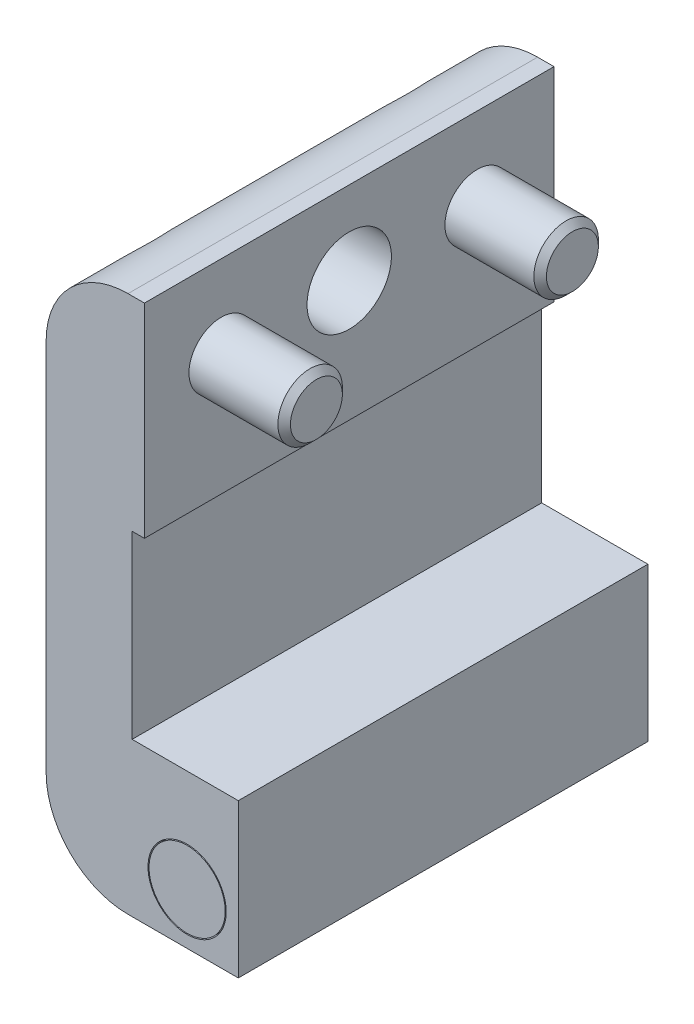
ISO-10303-21;
HEADER;
FILE_DESCRIPTION(('STEP AP214'),'2;1');
FILE_NAME('part.step','',(''),(''),'','','');
FILE_SCHEMA(('AUTOMOTIVE_DESIGN { 1 0 10303 214 1 1 1 1 }'));
ENDSEC;
DATA;
#1=APPLICATION_CONTEXT('core data for automotive mechanical design processes');
#2=APPLICATION_PROTOCOL_DEFINITION('international standard','automotive_design',2000,#1);
#3=PRODUCT_CONTEXT('',#1,'mechanical');
#4=PRODUCT('Part','Part','',(#3));
#5=PRODUCT_RELATED_PRODUCT_CATEGORY('part','',(#4));
#6=PRODUCT_DEFINITION_FORMATION('','',#4);
#7=PRODUCT_DEFINITION_CONTEXT('part definition',#1,'design');
#8=PRODUCT_DEFINITION('design','',#6,#7);
#9=PRODUCT_DEFINITION_SHAPE('','',#8);
#10=(LENGTH_UNIT() NAMED_UNIT(*) SI_UNIT(.MILLI.,.METRE.));
#11=(NAMED_UNIT(*) PLANE_ANGLE_UNIT() SI_UNIT($,.RADIAN.));
#12=(NAMED_UNIT(*) SI_UNIT($,.STERADIAN.) SOLID_ANGLE_UNIT());
#13=UNCERTAINTY_MEASURE_WITH_UNIT(LENGTH_MEASURE(1.E-05),#10,'distance_accuracy_value','');
#14=(GEOMETRIC_REPRESENTATION_CONTEXT(3) GLOBAL_UNCERTAINTY_ASSIGNED_CONTEXT((#13)) GLOBAL_UNIT_ASSIGNED_CONTEXT((#10,
#11,#12)) REPRESENTATION_CONTEXT('',''));
#15=CARTESIAN_POINT('',(0.,0.,0.));
#16=DIRECTION('',(0.,0.,1.));
#17=DIRECTION('',(1.,0.,0.));
#18=AXIS2_PLACEMENT_3D('',#15,#16,#17);
#19=CARTESIAN_POINT('',(2.647696,3.175,0.));
#20=DIRECTION('',(0.,0.,1.));
#21=DIRECTION('',(-1.,0.,0.));
#22=AXIS2_PLACEMENT_3D('',#19,#20,#21);
#23=CYLINDRICAL_SURFACE('',#22,2.3622);
#24=CARTESIAN_POINT('',(2.647696,3.175,0.));
#25=DIRECTION('',(0.,0.,-1.));
#26=DIRECTION('',(1.,0.,0.));
#27=AXIS2_PLACEMENT_3D('',#24,#25,#26);
#28=CIRCLE('',#27,2.3622);
#29=CARTESIAN_POINT('',(5.009896,3.175,0.));
#30=VERTEX_POINT('',#29);
#31=EDGE_CURVE('P0_E9',#30,#30,#28,.T.);
#32=ORIENTED_EDGE('',*,*,#31,.F.);
#33=EDGE_LOOP('',(#32));
#34=FACE_BOUND('',#33,.T.);
#35=CARTESIAN_POINT('',(2.647696,3.175,12.7));
#36=DIRECTION('',(0.,0.,-1.));
#37=DIRECTION('',(1.,0.,0.));
#38=AXIS2_PLACEMENT_3D('',#35,#36,#37);
#39=CIRCLE('',#38,2.3622);
#40=CARTESIAN_POINT('',(5.009896,3.175,12.7));
#41=VERTEX_POINT('',#40);
#42=EDGE_CURVE('P0_E19',#41,#41,#39,.T.);
#43=ORIENTED_EDGE('',*,*,#42,.T.);
#44=EDGE_LOOP('',(#43));
#45=FACE_BOUND('',#44,.T.);
#46=ADVANCED_FACE('P0_F13',(#34,#45),#23,.T.);
#47=CARTESIAN_POINT('',(2.647696,3.175,0.));
#48=DIRECTION('',(0.,0.,-1.));
#49=DIRECTION('',(1.,0.,0.));
#50=AXIS2_PLACEMENT_3D('',#47,#48,#49);
#51=PLANE('',#50);
#52=ORIENTED_EDGE('',*,*,#31,.T.);
#53=EDGE_LOOP('',(#52));
#54=FACE_BOUND('',#53,.T.);
#55=ADVANCED_FACE('P0_F28',(#54),#51,.T.);
#56=CARTESIAN_POINT('',(2.647696,3.175,12.7));
#57=DIRECTION('',(0.,0.,-1.));
#58=DIRECTION('',(1.,0.,0.));
#59=AXIS2_PLACEMENT_3D('',#56,#57,#58);
#60=PLANE('',#59);
#61=ORIENTED_EDGE('',*,*,#42,.F.);
#62=EDGE_LOOP('',(#61));
#63=FACE_BOUND('',#62,.T.);
#64=ADVANCED_FACE('P0_F26',(#63),#60,.F.);
#65=CLOSED_SHELL('',(#46,#55,#64));
#66=MANIFOLD_SOLID_BREP('P0_B1',#65);
#67=CARTESIAN_POINT('',(-3.296,28.9182278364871,-6.6875));
#68=DIRECTION('',(-1.,0.,0.));
#69=DIRECTION('',(0.,0.,1.));
#70=AXIS2_PLACEMENT_3D('',#67,#68,#69);
#71=PLANE('',#70);
#72=DIRECTION('',(0.,-0.5,0.86602540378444));
#73=VECTOR('',#72,1.);
#74=CARTESIAN_POINT('',(-3.296,29.6399156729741,-7.9375));
#75=LINE('',#74,#73);
#76=CARTESIAN_POINT('',(-3.296,29.6399156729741,-7.9375));
#77=VERTEX_POINT('',#76);
#78=CARTESIAN_POINT('',(-3.296,28.9182278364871,-6.6875));
#79=VERTEX_POINT('',#78);
#80=EDGE_CURVE('P1_E444',#77,#79,#75,.T.);
#81=ORIENTED_EDGE('',*,*,#80,.F.);
#82=DIRECTION('',(0.,-0.5,-0.866025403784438));
#83=VECTOR('',#82,1.);
#84=CARTESIAN_POINT('',(-3.296,29.6399156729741,-7.9375));
#85=LINE('',#84,#83);
#86=CARTESIAN_POINT('',(-3.296,28.9182278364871,-9.1875));
#87=VERTEX_POINT('',#86);
#88=EDGE_CURVE('P1_E447',#77,#87,#85,.T.);
#89=ORIENTED_EDGE('',*,*,#88,.T.);
#90=DIRECTION('',(0.,-1.,0.));
#91=VECTOR('',#90,1.);
#92=CARTESIAN_POINT('',(-3.296,28.9182278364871,-9.1875));
#93=LINE('',#92,#91);
#94=CARTESIAN_POINT('',(-3.296,27.4748521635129,-9.1875));
#95=VERTEX_POINT('',#94);
#96=EDGE_CURVE('P1_E460',#87,#95,#93,.T.);
#97=ORIENTED_EDGE('',*,*,#96,.T.);
#98=DIRECTION('',(0.,0.5,-0.86602540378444));
#99=VECTOR('',#98,1.);
#100=CARTESIAN_POINT('',(-3.296,26.7531643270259,-7.9375));
#101=LINE('',#100,#99);
#102=CARTESIAN_POINT('',(-3.296,26.7531643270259,-7.9375));
#103=VERTEX_POINT('',#102);
#104=EDGE_CURVE('P1_E462',#103,#95,#101,.T.);
#105=ORIENTED_EDGE('',*,*,#104,.F.);
#106=DIRECTION('',(0.,-0.5,-0.866025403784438));
#107=VECTOR('',#106,1.);
#108=CARTESIAN_POINT('',(-3.296,27.474852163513,-6.6875));
#109=LINE('',#108,#107);
#110=CARTESIAN_POINT('',(-3.296,27.474852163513,-6.6875));
#111=VERTEX_POINT('',#110);
#112=EDGE_CURVE('P1_E468',#111,#103,#109,.T.);
#113=ORIENTED_EDGE('',*,*,#112,.F.);
#114=DIRECTION('',(0.,1.,0.));
#115=VECTOR('',#114,1.);
#116=CARTESIAN_POINT('',(-3.296,27.474852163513,-6.6875));
#117=LINE('',#116,#115);
#118=EDGE_CURVE('P1_E450',#111,#79,#117,.T.);
#119=ORIENTED_EDGE('',*,*,#118,.T.);
#120=EDGE_LOOP('',(#81,#89,#97,#105,#113,#119));
#121=FACE_BOUND('',#120,.T.);
#122=ADVANCED_FACE('P1_F15',(#121),#71,.T.);
#123=CARTESIAN_POINT('',(-3.296,28.9182278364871,-9.1875));
#124=DIRECTION('',(0.,0.,-1.));
#125=DIRECTION('',(0.,1.,0.));
#126=AXIS2_PLACEMENT_3D('',#123,#124,#125);
#127=PLANE('',#126);
#128=DIRECTION('',(0.,-1.,0.));
#129=VECTOR('',#128,1.);
#130=CARTESIAN_POINT('',(-4.896,28.9182278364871,-9.1875));
#131=LINE('',#130,#129);
#132=CARTESIAN_POINT('',(-4.896,28.9182278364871,-9.1875));
#133=VERTEX_POINT('',#132);
#134=CARTESIAN_POINT('',(-4.896,27.4748521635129,-9.1875));
#135=VERTEX_POINT('',#134);
#136=EDGE_CURVE('P1_E472',#133,#135,#131,.T.);
#137=ORIENTED_EDGE('',*,*,#136,.T.);
#138=DIRECTION('',(-1.,0.,0.));
#139=VECTOR('',#138,1.);
#140=CARTESIAN_POINT('',(-3.296,27.4748521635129,-9.1875));
#141=LINE('',#140,#139);
#142=EDGE_CURVE('P1_E571',#95,#135,#141,.T.);
#143=ORIENTED_EDGE('',*,*,#142,.F.);
#144=ORIENTED_EDGE('',*,*,#96,.F.);
#145=DIRECTION('',(-1.,0.,0.));
#146=VECTOR('',#145,1.);
#147=CARTESIAN_POINT('',(-3.296,28.9182278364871,-9.1875));
#148=LINE('',#147,#146);
#149=EDGE_CURVE('P1_E458',#87,#133,#148,.T.);
#150=ORIENTED_EDGE('',*,*,#149,.T.);
#151=EDGE_LOOP('',(#137,#143,#144,#150));
#152=FACE_BOUND('',#151,.T.);
#153=ADVANCED_FACE('P1_F395',(#152),#127,.F.);
#154=CARTESIAN_POINT('',(-3.296,26.7531643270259,-7.9375));
#155=DIRECTION('',(0.,0.86602540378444,0.5));
#156=DIRECTION('',(0.,-0.5,0.86602540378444));
#157=AXIS2_PLACEMENT_3D('',#154,#155,#156);
#158=PLANE('',#157);
#159=DIRECTION('',(0.,0.5,-0.86602540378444));
#160=VECTOR('',#159,1.);
#161=CARTESIAN_POINT('',(-4.896,26.7531643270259,-7.9375));
#162=LINE('',#161,#160);
#163=CARTESIAN_POINT('',(-4.896,26.7531643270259,-7.9375));
#164=VERTEX_POINT('',#163);
#165=EDGE_CURVE('P1_E475',#164,#135,#162,.T.);
#166=ORIENTED_EDGE('',*,*,#165,.F.);
#167=DIRECTION('',(-1.,0.,0.));
#168=VECTOR('',#167,1.);
#169=CARTESIAN_POINT('',(-3.296,26.7531643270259,-7.9375));
#170=LINE('',#169,#168);
#171=EDGE_CURVE('P1_E569',#103,#164,#170,.T.);
#172=ORIENTED_EDGE('',*,*,#171,.F.);
#173=ORIENTED_EDGE('',*,*,#104,.T.);
#174=ORIENTED_EDGE('',*,*,#142,.T.);
#175=EDGE_LOOP('',(#166,#172,#173,#174));
#176=FACE_BOUND('',#175,.T.);
#177=ADVANCED_FACE('P1_F430',(#176),#158,.T.);
#178=CARTESIAN_POINT('',(-3.296,27.474852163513,-6.6875));
#179=DIRECTION('',(0.,0.866025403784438,-0.5));
#180=DIRECTION('',(0.,0.5,0.866025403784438));
#181=AXIS2_PLACEMENT_3D('',#178,#179,#180);
#182=PLANE('',#181);
#183=DIRECTION('',(0.,-0.5,-0.866025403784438));
#184=VECTOR('',#183,1.);
#185=CARTESIAN_POINT('',(-4.896,27.474852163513,-6.6875));
#186=LINE('',#185,#184);
#187=CARTESIAN_POINT('',(-4.896,27.474852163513,-6.6875));
#188=VERTEX_POINT('',#187);
#189=EDGE_CURVE('P1_E478',#188,#164,#186,.T.);
#190=ORIENTED_EDGE('',*,*,#189,.F.);
#191=DIRECTION('',(-1.,0.,0.));
#192=VECTOR('',#191,1.);
#193=CARTESIAN_POINT('',(-3.296,27.474852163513,-6.6875));
#194=LINE('',#193,#192);
#195=EDGE_CURVE('P1_E567',#111,#188,#194,.T.);
#196=ORIENTED_EDGE('',*,*,#195,.F.);
#197=ORIENTED_EDGE('',*,*,#112,.T.);
#198=ORIENTED_EDGE('',*,*,#171,.T.);
#199=EDGE_LOOP('',(#190,#196,#197,#198));
#200=FACE_BOUND('',#199,.T.);
#201=ADVANCED_FACE('P1_F426',(#200),#182,.T.);
#202=CARTESIAN_POINT('',(-3.296,27.474852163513,-6.6875));
#203=DIRECTION('',(0.,0.,1.));
#204=DIRECTION('',(0.,-1.,0.));
#205=AXIS2_PLACEMENT_3D('',#202,#203,#204);
#206=PLANE('',#205);
#207=DIRECTION('',(0.,1.,0.));
#208=VECTOR('',#207,1.);
#209=CARTESIAN_POINT('',(-4.896,27.474852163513,-6.6875));
#210=LINE('',#209,#208);
#211=CARTESIAN_POINT('',(-4.896,28.9182278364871,-6.6875));
#212=VERTEX_POINT('',#211);
#213=EDGE_CURVE('P1_E481',#188,#212,#210,.T.);
#214=ORIENTED_EDGE('',*,*,#213,.T.);
#215=DIRECTION('',(-1.,0.,0.));
#216=VECTOR('',#215,1.);
#217=CARTESIAN_POINT('',(-3.296,28.9182278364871,-6.6875));
#218=LINE('',#217,#216);
#219=EDGE_CURVE('P1_E565',#79,#212,#218,.T.);
#220=ORIENTED_EDGE('',*,*,#219,.F.);
#221=ORIENTED_EDGE('',*,*,#118,.F.);
#222=ORIENTED_EDGE('',*,*,#195,.T.);
#223=EDGE_LOOP('',(#214,#220,#221,#222));
#224=FACE_BOUND('',#223,.T.);
#225=ADVANCED_FACE('P1_F422',(#224),#206,.F.);
#226=CARTESIAN_POINT('',(-3.296,29.6399156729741,-7.9375));
#227=DIRECTION('',(0.,-0.86602540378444,-0.5));
#228=DIRECTION('',(0.,0.5,-0.86602540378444));
#229=AXIS2_PLACEMENT_3D('',#226,#227,#228);
#230=PLANE('',#229);
#231=DIRECTION('',(0.,-0.5,0.86602540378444));
#232=VECTOR('',#231,1.);
#233=CARTESIAN_POINT('',(-4.896,29.6399156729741,-7.9375));
#234=LINE('',#233,#232);
#235=CARTESIAN_POINT('',(-4.896,29.6399156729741,-7.9375));
#236=VERTEX_POINT('',#235);
#237=EDGE_CURVE('P1_E484',#236,#212,#234,.T.);
#238=ORIENTED_EDGE('',*,*,#237,.F.);
#239=DIRECTION('',(-1.,0.,0.));
#240=VECTOR('',#239,1.);
#241=CARTESIAN_POINT('',(-3.296,29.6399156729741,-7.9375));
#242=LINE('',#241,#240);
#243=EDGE_CURVE('P1_E456',#77,#236,#242,.T.);
#244=ORIENTED_EDGE('',*,*,#243,.F.);
#245=ORIENTED_EDGE('',*,*,#80,.T.);
#246=ORIENTED_EDGE('',*,*,#219,.T.);
#247=EDGE_LOOP('',(#238,#244,#245,#246));
#248=FACE_BOUND('',#247,.T.);
#249=ADVANCED_FACE('P1_F392',(#248),#230,.T.);
#250=CARTESIAN_POINT('',(-3.296,29.6399156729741,-7.9375));
#251=DIRECTION('',(0.,0.866025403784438,-0.5));
#252=DIRECTION('',(0.,0.5,0.866025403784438));
#253=AXIS2_PLACEMENT_3D('',#250,#251,#252);
#254=PLANE('',#253);
#255=DIRECTION('',(0.,-0.5,-0.866025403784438));
#256=VECTOR('',#255,1.);
#257=CARTESIAN_POINT('',(-4.896,29.6399156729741,-7.9375));
#258=LINE('',#257,#256);
#259=EDGE_CURVE('P1_E452',#236,#133,#258,.T.);
#260=ORIENTED_EDGE('',*,*,#259,.T.);
#261=ORIENTED_EDGE('',*,*,#149,.F.);
#262=ORIENTED_EDGE('',*,*,#88,.F.);
#263=ORIENTED_EDGE('',*,*,#243,.T.);
#264=EDGE_LOOP('',(#260,#261,#262,#263));
#265=FACE_BOUND('',#264,.T.);
#266=ADVANCED_FACE('P1_F383',(#265),#254,.F.);
#267=CARTESIAN_POINT('',(-4.896,28.19654,-7.9375));
#268=DIRECTION('',(-1.,0.,0.));
#269=DIRECTION('',(0.,0.,1.));
#270=AXIS2_PLACEMENT_3D('',#267,#268,#269);
#271=PLANE('',#270);
#272=CARTESIAN_POINT('',(-4.896,28.19654,-7.9375));
#273=DIRECTION('',(-1.,0.,0.));
#274=DIRECTION('',(0.,0.,1.));
#275=AXIS2_PLACEMENT_3D('',#272,#273,#274);
#276=CIRCLE('',#275,3.1);
#277=CARTESIAN_POINT('',(-4.896,28.19654,-4.8375));
#278=VERTEX_POINT('',#277);
#279=EDGE_CURVE('P1_E557',#278,#278,#276,.T.);
#280=ORIENTED_EDGE('',*,*,#279,.T.);
#281=EDGE_LOOP('',(#280));
#282=FACE_BOUND('',#281,.T.);
#283=ORIENTED_EDGE('',*,*,#259,.F.);
#284=ORIENTED_EDGE('',*,*,#237,.T.);
#285=ORIENTED_EDGE('',*,*,#213,.F.);
#286=ORIENTED_EDGE('',*,*,#189,.T.);
#287=ORIENTED_EDGE('',*,*,#165,.T.);
#288=ORIENTED_EDGE('',*,*,#136,.F.);
#289=EDGE_LOOP('',(#283,#284,#285,#286,#287,#288));
#290=FACE_BOUND('',#289,.T.);
#291=ADVANCED_FACE('P1_F380',(#282,#290),#271,.T.);
#292=CARTESIAN_POINT('',(-4.496,28.19654,-7.9375));
#293=DIRECTION('',(-1.,0.,0.));
#294=DIRECTION('',(0.,0.,1.));
#295=AXIS2_PLACEMENT_3D('',#292,#293,#294);
#296=TOROIDAL_SURFACE('',#295,3.1,0.4);
#297=CARTESIAN_POINT('',(-4.496,28.19654,-7.9375));
#298=DIRECTION('',(-1.,0.,0.));
#299=DIRECTION('',(0.,0.,1.));
#300=AXIS2_PLACEMENT_3D('',#297,#298,#299);
#301=CIRCLE('',#300,3.5);
#302=CARTESIAN_POINT('',(-4.496,28.19654,-4.4375));
#303=VERTEX_POINT('',#302);
#304=EDGE_CURVE('P1_E176',#303,#303,#301,.F.);
#305=ORIENTED_EDGE('',*,*,#304,.F.);
#306=EDGE_LOOP('',(#305));
#307=FACE_BOUND('',#306,.T.);
#308=ORIENTED_EDGE('',*,*,#279,.F.);
#309=EDGE_LOOP('',(#308));
#310=FACE_BOUND('',#309,.T.);
#311=ADVANCED_FACE('P1_F382',(#307,#310),#296,.T.);
#312=CARTESIAN_POINT('',(-36.646,28.19654,-7.9375));
#313=DIRECTION('',(-1.,0.,0.));
#314=DIRECTION('',(0.,0.,1.));
#315=AXIS2_PLACEMENT_3D('',#312,#313,#314);
#316=CYLINDRICAL_SURFACE('',#315,3.5);
#317=ORIENTED_EDGE('',*,*,#304,.T.);
#318=EDGE_LOOP('',(#317));
#319=FACE_BOUND('',#318,.T.);
#320=CARTESIAN_POINT('',(-2.096,28.19654,-7.9375));
#321=DIRECTION('',(-1.,0.,0.));
#322=DIRECTION('',(0.,0.,1.));
#323=AXIS2_PLACEMENT_3D('',#320,#321,#322);
#324=CIRCLE('',#323,3.5);
#325=CARTESIAN_POINT('',(-2.096,28.19654,-4.4375));
#326=VERTEX_POINT('',#325);
#327=EDGE_CURVE('P1_E167',#326,#326,#324,.T.);
#328=ORIENTED_EDGE('',*,*,#327,.T.);
#329=EDGE_LOOP('',(#328));
#330=FACE_BOUND('',#329,.T.);
#331=ADVANCED_FACE('P1_F345',(#319,#330),#316,.T.);
#332=CARTESIAN_POINT('',(2.647696,3.175,-1.27));
#333=DIRECTION('',(0.,0.,1.));
#334=DIRECTION('',(1.,0.,0.));
#335=AXIS2_PLACEMENT_3D('',#332,#333,#334);
#336=CONICAL_SURFACE('',#335,2.4257,1.02974425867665);
#337=CARTESIAN_POINT('',(2.647696,3.175,-2.72750760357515));
#338=VERTEX_POINT('',#337);
#339=VERTEX_LOOP('',#338);
#340=FACE_BOUND('',#339,.T.);
#341=CARTESIAN_POINT('',(2.647696,3.175,-1.27));
#342=DIRECTION('',(0.,0.,1.));
#343=DIRECTION('',(1.,0.,0.));
#344=AXIS2_PLACEMENT_3D('',#341,#342,#343);
#345=CIRCLE('',#344,2.4257);
#346=CARTESIAN_POINT('',(5.073396,3.175,-1.27));
#347=VERTEX_POINT('',#346);
#348=EDGE_CURVE('P1_E235',#347,#347,#345,.T.);
#349=ORIENTED_EDGE('',*,*,#348,.T.);
#350=EDGE_LOOP('',(#349));
#351=FACE_BOUND('',#350,.T.);
#352=ADVANCED_FACE('P1_F341',(#340,#351),#336,.F.);
#353=CARTESIAN_POINT('',(2.647696,3.175,12.7));
#354=DIRECTION('',(0.,0.,1.));
#355=DIRECTION('',(1.,0.,0.));
#356=AXIS2_PLACEMENT_3D('',#353,#354,#355);
#357=CYLINDRICAL_SURFACE('',#356,2.4257);
#358=ORIENTED_EDGE('',*,*,#348,.F.);
#359=EDGE_LOOP('',(#358));
#360=FACE_BOUND('',#359,.T.);
#361=CARTESIAN_POINT('',(2.647696,3.175,12.7));
#362=DIRECTION('',(0.,0.,1.));
#363=DIRECTION('',(1.,0.,0.));
#364=AXIS2_PLACEMENT_3D('',#361,#362,#363);
#365=CIRCLE('',#364,2.4257);
#366=CARTESIAN_POINT('',(5.073396,3.175,12.7));
#367=VERTEX_POINT('',#366);
#368=EDGE_CURVE('P1_E255',#367,#367,#365,.T.);
#369=ORIENTED_EDGE('',*,*,#368,.T.);
#370=EDGE_LOOP('',(#369));
#371=FACE_BOUND('',#370,.T.);
#372=ADVANCED_FACE('P1_F337',(#360,#371),#357,.F.);
#373=CARTESIAN_POINT('',(5.822696,0.,12.7));
#374=DIRECTION('',(-1.,0.,0.));
#375=DIRECTION('',(0.,0.,1.));
#376=AXIS2_PLACEMENT_3D('',#373,#374,#375);
#377=PLANE('',#376);
#378=DIRECTION('',(0.,1.,0.));
#379=VECTOR('',#378,1.);
#380=CARTESIAN_POINT('',(5.822696,0.,-12.7));
#381=LINE('',#380,#379);
#382=CARTESIAN_POINT('',(5.822696,0.,-12.7));
#383=VERTEX_POINT('',#382);
#384=CARTESIAN_POINT('',(5.822696,9.525,-12.7));
#385=VERTEX_POINT('',#384);
#386=EDGE_CURVE('P1_E215',#383,#385,#381,.T.);
#387=ORIENTED_EDGE('',*,*,#386,.T.);
#388=DIRECTION('',(0.,0.,-1.));
#389=VECTOR('',#388,1.);
#390=CARTESIAN_POINT('',(5.822696,9.525,12.7));
#391=LINE('',#390,#389);
#392=CARTESIAN_POINT('',(5.822696,9.525,12.7));
#393=VERTEX_POINT('',#392);
#394=EDGE_CURVE('P1_E211',#393,#385,#391,.T.);
#395=ORIENTED_EDGE('',*,*,#394,.F.);
#396=DIRECTION('',(0.,1.,0.));
#397=VECTOR('',#396,1.);
#398=CARTESIAN_POINT('',(5.822696,0.,12.7));
#399=LINE('',#398,#397);
#400=CARTESIAN_POINT('',(5.822696,0.,12.7));
#401=VERTEX_POINT('',#400);
#402=EDGE_CURVE('P1_E214',#401,#393,#399,.T.);
#403=ORIENTED_EDGE('',*,*,#402,.F.);
#404=DIRECTION('',(0.,0.,-1.));
#405=VECTOR('',#404,1.);
#406=CARTESIAN_POINT('',(5.822696,0.,12.7));
#407=LINE('',#406,#405);
#408=EDGE_CURVE('P1_E208',#401,#383,#407,.T.);
#409=ORIENTED_EDGE('',*,*,#408,.T.);
#410=EDGE_LOOP('',(#387,#395,#403,#409));
#411=FACE_BOUND('',#410,.T.);
#412=ADVANCED_FACE('P1_F340',(#411),#377,.F.);
#413=CARTESIAN_POINT('',(5.822696,9.525,12.7));
#414=DIRECTION('',(0.,-1.,0.));
#415=DIRECTION('',(1.,0.,0.));
#416=AXIS2_PLACEMENT_3D('',#413,#414,#415);
#417=PLANE('',#416);
#418=DIRECTION('',(-1.,0.,0.));
#419=VECTOR('',#418,1.);
#420=CARTESIAN_POINT('',(5.822696,9.525,-12.7));
#421=LINE('',#420,#419);
#422=CARTESIAN_POINT('',(-0.762,9.525,-12.7));
#423=VERTEX_POINT('',#422);
#424=EDGE_CURVE('P1_E232',#385,#423,#421,.T.);
#425=ORIENTED_EDGE('',*,*,#424,.T.);
#426=DIRECTION('',(0.,0.,-1.));
#427=VECTOR('',#426,1.);
#428=CARTESIAN_POINT('',(-0.762,9.525,12.7));
#429=LINE('',#428,#427);
#430=CARTESIAN_POINT('',(-0.762,9.525,12.7));
#431=VERTEX_POINT('',#430);
#432=EDGE_CURVE('P1_E196',#431,#423,#429,.T.);
#433=ORIENTED_EDGE('',*,*,#432,.F.);
#434=DIRECTION('',(-1.,0.,0.));
#435=VECTOR('',#434,1.);
#436=CARTESIAN_POINT('',(5.822696,9.525,12.7));
#437=LINE('',#436,#435);
#438=EDGE_CURVE('P1_E218',#393,#431,#437,.T.);
#439=ORIENTED_EDGE('',*,*,#438,.F.);
#440=ORIENTED_EDGE('',*,*,#394,.T.);
#441=EDGE_LOOP('',(#425,#433,#439,#440));
#442=FACE_BOUND('',#441,.T.);
#443=ADVANCED_FACE('P1_F354',(#442),#417,.F.);
#444=CARTESIAN_POINT('',(-0.762,9.525,12.7));
#445=DIRECTION('',(-1.,0.,0.));
#446=DIRECTION('',(0.,0.,1.));
#447=AXIS2_PLACEMENT_3D('',#444,#445,#446);
#448=PLANE('',#447);
#449=DIRECTION('',(0.,1.,0.));
#450=VECTOR('',#449,1.);
#451=CARTESIAN_POINT('',(-0.762,9.525,-12.7));
#452=LINE('',#451,#450);
#453=CARTESIAN_POINT('',(-0.762,20.701,-12.7));
#454=VERTEX_POINT('',#453);
#455=EDGE_CURVE('P1_E230',#423,#454,#452,.T.);
#456=ORIENTED_EDGE('',*,*,#455,.T.);
#457=DIRECTION('',(0.,0.,-1.));
#458=VECTOR('',#457,1.);
#459=CARTESIAN_POINT('',(-0.762,20.701,12.7));
#460=LINE('',#459,#458);
#461=CARTESIAN_POINT('',(-0.762,20.701,12.7));
#462=VERTEX_POINT('',#461);
#463=EDGE_CURVE('P1_E199',#462,#454,#460,.T.);
#464=ORIENTED_EDGE('',*,*,#463,.F.);
#465=DIRECTION('',(0.,1.,0.));
#466=VECTOR('',#465,1.);
#467=CARTESIAN_POINT('',(-0.762,9.525,12.7));
#468=LINE('',#467,#466);
#469=EDGE_CURVE('P1_E249',#431,#462,#468,.T.);
#470=ORIENTED_EDGE('',*,*,#469,.F.);
#471=ORIENTED_EDGE('',*,*,#432,.T.);
#472=EDGE_LOOP('',(#456,#464,#470,#471));
#473=FACE_BOUND('',#472,.T.);
#474=ADVANCED_FACE('P1_F368',(#473),#448,.F.);
#475=CARTESIAN_POINT('',(-1.016,5.08,12.7));
#476=DIRECTION('',(0.,0.,-1.));
#477=DIRECTION('',(-1.,0.,0.));
#478=AXIS2_PLACEMENT_3D('',#475,#476,#477);
#479=CYLINDRICAL_SURFACE('',#478,5.08);
#480=CARTESIAN_POINT('',(-1.016,5.08,12.7));
#481=DIRECTION('',(0.,0.,-1.));
#482=DIRECTION('',(-1.,0.,0.));
#483=AXIS2_PLACEMENT_3D('',#480,#481,#482);
#484=CIRCLE('',#483,5.08);
#485=CARTESIAN_POINT('',(-6.096,5.08,12.7));
#486=VERTEX_POINT('',#485);
#487=CARTESIAN_POINT('',(-1.016,0.,12.7));
#488=VERTEX_POINT('',#487);
#489=EDGE_CURVE('P1_E1046',#486,#488,#484,.F.);
#490=ORIENTED_EDGE('',*,*,#489,.F.);
#491=DIRECTION('',(0.,0.,-1.));
#492=VECTOR('',#491,1.);
#493=CARTESIAN_POINT('',(-6.096,5.08,12.7));
#494=LINE('',#493,#492);
#495=CARTESIAN_POINT('',(-6.096,5.08,-12.7));
#496=VERTEX_POINT('',#495);
#497=EDGE_CURVE('P1_E1047',#496,#486,#494,.F.);
#498=ORIENTED_EDGE('',*,*,#497,.F.);
#499=CARTESIAN_POINT('',(-1.016,5.08,-12.7));
#500=DIRECTION('',(0.,0.,-1.));
#501=DIRECTION('',(-1.,0.,0.));
#502=AXIS2_PLACEMENT_3D('',#499,#500,#501);
#503=CIRCLE('',#502,5.08);
#504=CARTESIAN_POINT('',(-1.016,0.,-12.7));
#505=VERTEX_POINT('',#504);
#506=EDGE_CURVE('P1_E184',#505,#496,#503,.T.);
#507=ORIENTED_EDGE('',*,*,#506,.F.);
#508=DIRECTION('',(0.,0.,-1.));
#509=VECTOR('',#508,1.);
#510=CARTESIAN_POINT('',(-1.016,0.,12.7));
#511=LINE('',#510,#509);
#512=EDGE_CURVE('P1_E193',#488,#505,#511,.T.);
#513=ORIENTED_EDGE('',*,*,#512,.F.);
#514=EDGE_LOOP('',(#490,#498,#507,#513));
#515=FACE_BOUND('',#514,.T.);
#516=ADVANCED_FACE('P1_F359',(#515),#479,.T.);
#517=CARTESIAN_POINT('',(-6.096,0.,12.7));
#518=DIRECTION('',(0.,1.,0.));
#519=DIRECTION('',(-1.,0.,0.));
#520=AXIS2_PLACEMENT_3D('',#517,#518,#519);
#521=PLANE('',#520);
#522=DIRECTION('',(1.,0.,0.));
#523=VECTOR('',#522,1.);
#524=CARTESIAN_POINT('',(-6.096,0.,12.7));
#525=LINE('',#524,#523);
#526=EDGE_CURVE('P1_E237',#488,#401,#525,.T.);
#527=ORIENTED_EDGE('',*,*,#526,.F.);
#528=ORIENTED_EDGE('',*,*,#512,.T.);
#529=DIRECTION('',(1.,0.,0.));
#530=VECTOR('',#529,1.);
#531=CARTESIAN_POINT('',(-6.096,0.,-12.7));
#532=LINE('',#531,#530);
#533=EDGE_CURVE('P1_E217',#505,#383,#532,.T.);
#534=ORIENTED_EDGE('',*,*,#533,.T.);
#535=ORIENTED_EDGE('',*,*,#408,.F.);
#536=EDGE_LOOP('',(#527,#528,#534,#535));
#537=FACE_BOUND('',#536,.T.);
#538=ADVANCED_FACE('P1_F356',(#537),#521,.F.);
#539=CARTESIAN_POINT('',(-1.016,28.2575,12.7));
#540=DIRECTION('',(0.,0.,-1.));
#541=DIRECTION('',(-1.,0.,0.));
#542=AXIS2_PLACEMENT_3D('',#539,#540,#541);
#543=CYLINDRICAL_SURFACE('',#542,5.08);
#544=CARTESIAN_POINT('',(-6.096,28.2575,2.61548968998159));
#545=CARTESIAN_POINT('',(-6.09601245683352,28.3264656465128,2.61389355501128));
#546=CARTESIAN_POINT('',(-6.09459592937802,28.3953584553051,2.609547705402));
#547=CARTESIAN_POINT('',(-6.08901432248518,28.5324481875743,2.59545730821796));
#548=CARTESIAN_POINT('',(-6.08485044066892,28.6006454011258,2.58571511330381));
#549=CARTESIAN_POINT('',(-6.07390899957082,28.7355386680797,2.56098912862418));
#550=CARTESIAN_POINT('',(-6.06714375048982,28.8022402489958,2.54603005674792));
#551=CARTESIAN_POINT('',(-6.0511935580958,28.9339885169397,2.51104035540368));
#552=CARTESIAN_POINT('',(-6.04200844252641,28.9990350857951,2.49100936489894));
#553=CARTESIAN_POINT('',(-6.01119002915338,29.1908661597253,2.42365996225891));
#554=CARTESIAN_POINT('',(-5.98626746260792,29.3146452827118,2.36902860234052));
#555=CARTESIAN_POINT('',(-5.93000789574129,29.5512483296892,2.24217543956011));
#556=CARTESIAN_POINT('',(-5.89866406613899,29.6640603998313,2.16993489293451));
#557=CARTESIAN_POINT('',(-5.83021528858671,29.8834598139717,2.00470117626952));
#558=CARTESIAN_POINT('',(-5.79287135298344,29.9892022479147,1.91068447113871));
#559=CARTESIAN_POINT('',(-5.71762462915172,30.1841736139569,1.70696296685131));
#560=CARTESIAN_POINT('',(-5.67972148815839,30.273391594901,1.59724784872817));
#561=CARTESIAN_POINT('',(-5.60445763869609,30.4395634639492,1.35517551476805));
#562=CARTESIAN_POINT('',(-5.56735862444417,30.5150636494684,1.22172976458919));
#563=CARTESIAN_POINT('',(-5.50209778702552,30.6421321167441,0.941880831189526));
#564=CARTESIAN_POINT('',(-5.47392807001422,30.6937215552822,0.79548923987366));
#565=CARTESIAN_POINT('',(-5.43262548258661,30.767782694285,0.504202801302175));
#566=CARTESIAN_POINT('',(-5.41860021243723,30.7919961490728,0.359883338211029));
#567=CARTESIAN_POINT('',(-5.40475388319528,30.815910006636,0.0686000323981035));
#568=CARTESIAN_POINT('',(-5.40492062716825,30.8156314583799,-0.0783614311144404));
#569=CARTESIAN_POINT('',(-5.41852133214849,30.7921245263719,-0.352274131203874));
#570=CARTESIAN_POINT('',(-5.43039596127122,30.7715933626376,-0.479549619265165));
#571=CARTESIAN_POINT('',(-5.46352552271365,30.7125059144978,-0.728561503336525));
#572=CARTESIAN_POINT('',(-5.48478347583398,30.673943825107,-0.850296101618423));
#573=CARTESIAN_POINT('',(-5.53508116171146,30.5785546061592,-1.08982849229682));
#574=CARTESIAN_POINT('',(-5.5643707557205,30.5211266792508,-1.20733231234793));
#575=CARTESIAN_POINT('',(-5.62725946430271,30.3900960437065,-1.43168191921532));
#576=CARTESIAN_POINT('',(-5.66086073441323,30.3164852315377,-1.53852232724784));
#577=CARTESIAN_POINT('',(-5.73373508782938,30.1440847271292,-1.75295292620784));
#578=CARTESIAN_POINT('',(-5.773181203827,30.0432730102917,-1.85886663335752));
#579=CARTESIAN_POINT('',(-5.84954506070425,29.8248702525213,-2.05290344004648));
#580=CARTESIAN_POINT('',(-5.88646146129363,29.7072704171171,-2.1410171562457));
#581=CARTESIAN_POINT('',(-5.95509700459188,29.4531362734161,-2.29969602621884));
#582=CARTESIAN_POINT('',(-5.98659262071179,29.316088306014,-2.36955001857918));
#583=CARTESIAN_POINT('',(-6.02585955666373,29.1019010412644,-2.45576194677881));
#584=CARTESIAN_POINT('',(-6.03761635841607,29.0290967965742,-2.48139859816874));
#585=CARTESIAN_POINT('',(-6.0581275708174,28.8811301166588,-2.52622309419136));
#586=CARTESIAN_POINT('',(-6.06688348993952,28.8059688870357,-2.54541417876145));
#587=CARTESIAN_POINT('',(-6.08122048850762,28.6524514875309,-2.57738405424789));
#588=CARTESIAN_POINT('',(-6.08673628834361,28.5740615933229,-2.59003042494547));
#589=CARTESIAN_POINT('',(-6.09413643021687,28.4163145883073,-2.60816609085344));
#590=CARTESIAN_POINT('',(-6.09602184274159,28.3369577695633,-2.61365749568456));
#591=CARTESIAN_POINT('',(-6.096,28.2575,-2.61548968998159));
#592=B_SPLINE_CURVE_WITH_KNOTS('',3,(#544,#545,#546,#547,#548,#549,#550,#551,#552,#553,#554,
#555,#556,#557,#558,#559,#560,#561,#562,#563,#564,#565,#566,#567,#568,#569,#570,#571,#572,#573,
#574,#575,#576,#577,#578,#579,#580,#581,#582,#583,#584,#585,#586,#587,#588,#589,#590,#591),
.UNSPECIFIED.,.F.,.F.,(4,2,2,2,2,2,2,2,2,2,2,2,2,2,2,2,2,2,2,2,2,2,2,4),(0.,0.206869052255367,
0.413647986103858,0.619460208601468,0.825287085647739,1.23602382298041,1.64719968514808,
2.08438010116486,2.5218492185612,2.99267276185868,3.46307891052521,3.90149110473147,
4.33952652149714,4.72615427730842,5.11290659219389,5.51341318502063,5.91412078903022,
6.36644900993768,6.81901505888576,7.28721108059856,7.52114291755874,7.7549569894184,
7.99333314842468,8.23163900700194),.UNSPECIFIED.);
#593=CARTESIAN_POINT('',(-6.096,28.2575,2.61548968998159));
#594=VERTEX_POINT('',#593);
#595=CARTESIAN_POINT('',(-6.096,28.2575,-2.61548968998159));
#596=VERTEX_POINT('',#595);
#597=EDGE_CURVE('P1_E159',#594,#596,#592,.T.);
#598=ORIENTED_EDGE('',*,*,#597,.F.);
#599=DIRECTION('',(0.,0.,-1.));
#600=VECTOR('',#599,1.);
#601=CARTESIAN_POINT('',(-6.096,28.2575,12.7));
#602=LINE('',#601,#600);
#603=CARTESIAN_POINT('',(-6.096,28.2575,3.93796454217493));
#604=VERTEX_POINT('',#603);
#605=EDGE_CURVE('P1_E175',#604,#594,#602,.T.);
#606=ORIENTED_EDGE('',*,*,#605,.F.);
#607=CARTESIAN_POINT('',(-6.096,28.2575,11.9370354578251));
#608=CARTESIAN_POINT('',(-6.09602258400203,28.3548106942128,11.9355735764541));
#609=CARTESIAN_POINT('',(-6.09320466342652,28.4520490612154,11.9305187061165));
#610=CARTESIAN_POINT('',(-6.08207920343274,28.6455249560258,11.9134014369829));
#611=CARTESIAN_POINT('',(-6.07377546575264,28.7417631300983,11.901343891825));
#612=CARTESIAN_POINT('',(-6.05194678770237,28.9318443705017,11.8705067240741));
#613=CARTESIAN_POINT('',(-6.0384592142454,29.025699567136,11.8517752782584));
#614=CARTESIAN_POINT('',(-6.00659458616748,29.21103025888,11.807886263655));
#615=CARTESIAN_POINT('',(-5.98821692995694,29.3025054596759,11.7827279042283));
#616=CARTESIAN_POINT('',(-5.92642790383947,29.5719983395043,11.6982729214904));
#617=CARTESIAN_POINT('',(-5.87628178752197,29.7457332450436,11.6298877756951));
#618=CARTESIAN_POINT('',(-5.76174621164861,30.0783189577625,11.4720361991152));
#619=CARTESIAN_POINT('',(-5.69733522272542,30.2371467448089,11.3825378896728));
#620=CARTESIAN_POINT('',(-5.55160667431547,30.5526437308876,11.1759669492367));
#621=CARTESIAN_POINT('',(-5.46925842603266,30.7076327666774,11.0570690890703));
#622=CARTESIAN_POINT('',(-5.29743705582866,30.9968464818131,10.800324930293));
#623=CARTESIAN_POINT('',(-5.20795458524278,31.1310432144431,10.6624535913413));
#624=CARTESIAN_POINT('',(-5.0628350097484,31.3296685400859,10.426897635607));
#625=CARTESIAN_POINT('',(-5.00763300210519,31.4008715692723,10.3345563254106));
#626=CARTESIAN_POINT('',(-4.89807994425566,31.5352065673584,10.1436138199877));
#627=CARTESIAN_POINT('',(-4.8437291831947,31.5983358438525,10.0450105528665));
#628=CARTESIAN_POINT('',(-4.73760124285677,31.716164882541,9.84171415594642));
#629=CARTESIAN_POINT('',(-4.68582156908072,31.7708729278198,9.73702715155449));
#630=CARTESIAN_POINT('',(-4.58680884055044,31.8714597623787,9.52151174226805));
#631=CARTESIAN_POINT('',(-4.53957295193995,31.9173440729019,9.41068723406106));
#632=CARTESIAN_POINT('',(-4.44062629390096,32.0103723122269,9.15322537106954));
#633=CARTESIAN_POINT('',(-4.3909431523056,32.0547442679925,9.00476618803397));
#634=CARTESIAN_POINT('',(-4.30854336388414,32.1264296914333,8.69933011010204));
#635=CARTESIAN_POINT('',(-4.27578507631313,32.1537850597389,8.54237517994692));
#636=CARTESIAN_POINT('',(-4.2432414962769,32.1806987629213,8.30232601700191));
#637=CARTESIAN_POINT('',(-4.23516155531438,32.18731338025,8.22107315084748));
#638=CARTESIAN_POINT('',(-4.22507138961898,32.1955593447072,8.05792216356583));
#639=CARTESIAN_POINT('',(-4.22306077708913,32.1971910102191,7.97602408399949));
#640=CARTESIAN_POINT('',(-4.2252343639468,32.1954200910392,7.8123609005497));
#641=CARTESIAN_POINT('',(-4.22941922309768,32.1920169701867,7.73059581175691));
#642=CARTESIAN_POINT('',(-4.24375460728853,32.1802649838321,7.56791812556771));
#643=CARTESIAN_POINT('',(-4.25390817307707,32.1719135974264,7.48700598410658));
#644=CARTESIAN_POINT('',(-4.28071277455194,32.1495915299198,7.32023116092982));
#645=CARTESIAN_POINT('',(-4.29782209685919,32.1352217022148,7.23449601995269));
#646=CARTESIAN_POINT('',(-4.33754000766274,32.1012554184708,7.06534633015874));
#647=CARTESIAN_POINT('',(-4.36015230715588,32.0816554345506,6.98193338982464));
#648=CARTESIAN_POINT('',(-4.43486911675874,32.0154435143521,6.73544124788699));
#649=CARTESIAN_POINT('',(-4.49380926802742,31.9614539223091,6.57635365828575));
#650=CARTESIAN_POINT('',(-4.6045072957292,31.8537779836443,6.31305198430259));
#651=CARTESIAN_POINT('',(-4.65366429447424,31.8042290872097,6.20593387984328));
#652=CARTESIAN_POINT('',(-4.75551465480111,31.6966731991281,5.99770910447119));
#653=CARTESIAN_POINT('',(-4.80820949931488,31.638662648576,5.89660498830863));
#654=CARTESIAN_POINT('',(-4.91538371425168,31.5144842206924,5.70037023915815));
#655=CARTESIAN_POINT('',(-4.96986509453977,31.4483069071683,5.60524671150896));
#656=CARTESIAN_POINT('',(-5.07905619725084,31.3080529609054,5.42117934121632));
#657=CARTESIAN_POINT('',(-5.13376588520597,31.2339774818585,5.33223459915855));
#658=CARTESIAN_POINT('',(-5.24349909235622,31.0760340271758,5.15853562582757));
#659=CARTESIAN_POINT('',(-5.29849464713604,30.9919635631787,5.07394746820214));
#660=CARTESIAN_POINT('',(-5.40604913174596,30.8157280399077,4.91191157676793));
#661=CARTESIAN_POINT('',(-5.45860773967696,30.7235619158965,4.83446478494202));
#662=CARTESIAN_POINT('',(-5.5599231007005,30.531465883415,4.68746794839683));
#663=CARTESIAN_POINT('',(-5.60868667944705,30.4315505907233,4.61790361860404));
#664=CARTESIAN_POINT('',(-5.7012331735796,30.2241985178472,4.48733626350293));
#665=CARTESIAN_POINT('',(-5.7450180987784,30.1167648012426,4.42632978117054));
#666=CARTESIAN_POINT('',(-5.84589885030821,29.8414649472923,4.28674371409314));
#667=CARTESIAN_POINT('',(-5.89933408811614,29.6692872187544,4.21373037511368));
#668=CARTESIAN_POINT('',(-5.96627171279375,29.4019148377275,4.12227173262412));
#669=CARTESIAN_POINT('',(-5.9863744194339,29.3113244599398,4.09480571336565));
#670=CARTESIAN_POINT('',(-6.02181167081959,29.1275547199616,4.04619753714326));
#671=CARTESIAN_POINT('',(-6.03714771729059,29.0343761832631,4.02505338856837));
#672=CARTESIAN_POINT('',(-6.06507303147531,28.8284215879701,3.98608988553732));
#673=CARTESIAN_POINT('',(-6.07661170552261,28.715240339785,3.96963253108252));
#674=CARTESIAN_POINT('',(-6.09210219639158,28.4872417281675,3.94641850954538));
#675=CARTESIAN_POINT('',(-6.09604489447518,28.3724225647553,3.93967350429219));
#676=CARTESIAN_POINT('',(-6.096,28.2575,3.93796454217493));
#677=B_SPLINE_CURVE_WITH_KNOTS('',3,(#607,#608,#609,#610,#611,#612,#613,#614,#615,#616,#617,
#618,#619,#620,#621,#622,#623,#624,#625,#626,#627,#628,#629,#630,#631,#632,#633,#634,#635,#636,
#637,#638,#639,#640,#641,#642,#643,#644,#645,#646,#647,#648,#649,#650,#651,#652,#653,#654,#655,
#656,#657,#658,#659,#660,#661,#662,#663,#664,#665,#666,#667,#668,#669,#670,#671,#672,#673,#674,
#675,#676),.UNSPECIFIED.,.F.,.F.,(4,2,2,2,2,2,2,2,2,2,2,2,2,2,2,2,2,2,2,2,2,2,2,2,2,2,2,2,2,2,2,
2,2,2,4),(0.,0.29183022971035,0.583458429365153,0.873022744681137,1.16262269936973,
1.73985757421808,2.31796965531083,2.95174283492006,3.58636060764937,3.9730455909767,
4.35985919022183,4.74628985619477,5.13247792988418,5.6190354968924,6.10439020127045,
6.3498249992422,6.59524411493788,6.84068936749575,7.08625977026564,7.35165103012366,
7.61722175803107,8.14910751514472,8.53225063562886,8.91555537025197,9.29930721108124,
9.68300307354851,10.0765437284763,10.4701362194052,10.8630036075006,11.2557118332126,
11.8363963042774,12.1264254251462,12.4163630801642,12.7605416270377,13.105133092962),.UNSPECIFIED.);
#678=CARTESIAN_POINT('',(-6.096,28.2575,11.9370354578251));
#679=VERTEX_POINT('',#678);
#680=EDGE_CURVE('P1_E297',#679,#604,#677,.T.);
#681=ORIENTED_EDGE('',*,*,#680,.F.);
#682=DIRECTION('',(0.,0.,-1.));
#683=VECTOR('',#682,1.);
#684=CARTESIAN_POINT('',(-6.096,28.2575,12.7));
#685=LINE('',#684,#683);
#686=CARTESIAN_POINT('',(-6.096,28.2575,12.7));
#687=VERTEX_POINT('',#686);
#688=EDGE_CURVE('P1_E186',#687,#679,#685,.T.);
#689=ORIENTED_EDGE('',*,*,#688,.F.);
#690=CARTESIAN_POINT('',(-1.016,28.2575,12.7));
#691=DIRECTION('',(0.,0.,-1.));
#692=DIRECTION('',(-1.,0.,0.));
#693=AXIS2_PLACEMENT_3D('',#690,#691,#692);
#694=CIRCLE('',#693,5.08);
#695=CARTESIAN_POINT('',(-1.016,33.3375,12.7));
#696=VERTEX_POINT('',#695);
#697=EDGE_CURVE('P1_E295',#696,#687,#694,.F.);
#698=ORIENTED_EDGE('',*,*,#697,.F.);
#699=DIRECTION('',(0.,0.,-1.));
#700=VECTOR('',#699,1.);
#701=CARTESIAN_POINT('',(-1.016,33.3375,12.7));
#702=LINE('',#701,#700);
#703=CARTESIAN_POINT('',(-1.016,33.3375,-12.7));
#704=VERTEX_POINT('',#703);
#705=EDGE_CURVE('P1_E166',#704,#696,#702,.F.);
#706=ORIENTED_EDGE('',*,*,#705,.F.);
#707=CARTESIAN_POINT('',(-1.016,28.2575,-12.7));
#708=DIRECTION('',(0.,0.,-1.));
#709=DIRECTION('',(-1.,0.,0.));
#710=AXIS2_PLACEMENT_3D('',#707,#708,#709);
#711=CIRCLE('',#710,5.08);
#712=CARTESIAN_POINT('',(-6.096,28.2575,-12.7));
#713=VERTEX_POINT('',#712);
#714=EDGE_CURVE('P1_E191',#713,#704,#711,.T.);
#715=ORIENTED_EDGE('',*,*,#714,.F.);
#716=DIRECTION('',(0.,0.,-1.));
#717=VECTOR('',#716,1.);
#718=CARTESIAN_POINT('',(-6.096,28.2575,12.7));
#719=LINE('',#718,#717);
#720=CARTESIAN_POINT('',(-6.096,28.2575,-11.9370354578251));
#721=VERTEX_POINT('',#720);
#722=EDGE_CURVE('P1_E182',#721,#713,#719,.T.);
#723=ORIENTED_EDGE('',*,*,#722,.F.);
#724=CARTESIAN_POINT('',(-6.096,28.2575,-3.93796454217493));
#725=CARTESIAN_POINT('',(-6.09602258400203,28.3548106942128,-3.93942642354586));
#726=CARTESIAN_POINT('',(-6.09320466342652,28.4520490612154,-3.94448129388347));
#727=CARTESIAN_POINT('',(-6.08207920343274,28.6455249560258,-3.96159856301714));
#728=CARTESIAN_POINT('',(-6.07377546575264,28.7417631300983,-3.97365610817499));
#729=CARTESIAN_POINT('',(-6.05194678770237,28.9318443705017,-4.00449327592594));
#730=CARTESIAN_POINT('',(-6.0384592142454,29.025699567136,-4.02322472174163));
#731=CARTESIAN_POINT('',(-6.00659458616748,29.21103025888,-4.06711373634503));
#732=CARTESIAN_POINT('',(-5.98821692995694,29.3025054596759,-4.09227209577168));
#733=CARTESIAN_POINT('',(-5.92642790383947,29.5719983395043,-4.17672707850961));
#734=CARTESIAN_POINT('',(-5.87628178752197,29.7457332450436,-4.2451122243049));
#735=CARTESIAN_POINT('',(-5.76174621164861,30.0783189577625,-4.40296380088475));
#736=CARTESIAN_POINT('',(-5.69733522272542,30.2371467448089,-4.49246211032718));
#737=CARTESIAN_POINT('',(-5.55160667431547,30.5526437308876,-4.69903305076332));
#738=CARTESIAN_POINT('',(-5.46925842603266,30.7076327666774,-4.81793091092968));
#739=CARTESIAN_POINT('',(-5.29743705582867,30.9968464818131,-5.074675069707));
#740=CARTESIAN_POINT('',(-5.20795458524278,31.1310432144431,-5.21254640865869));
#741=CARTESIAN_POINT('',(-5.0628350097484,31.3296685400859,-5.44810236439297));
#742=CARTESIAN_POINT('',(-5.00763300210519,31.4008715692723,-5.54044367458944));
#743=CARTESIAN_POINT('',(-4.89807994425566,31.5352065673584,-5.73138618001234));
#744=CARTESIAN_POINT('',(-4.8437291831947,31.5983358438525,-5.82998944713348));
#745=CARTESIAN_POINT('',(-4.73760124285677,31.716164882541,-6.03328584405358));
#746=CARTESIAN_POINT('',(-4.68582156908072,31.7708729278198,-6.13797284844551));
#747=CARTESIAN_POINT('',(-4.58680884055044,31.8714597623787,-6.35348825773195));
#748=CARTESIAN_POINT('',(-4.53957295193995,31.9173440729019,-6.46431276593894));
#749=CARTESIAN_POINT('',(-4.44062629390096,32.0103723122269,-6.72177462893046));
#750=CARTESIAN_POINT('',(-4.39094315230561,32.0547442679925,-6.87023381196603));
#751=CARTESIAN_POINT('',(-4.30854336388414,32.1264296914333,-7.17566988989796));
#752=CARTESIAN_POINT('',(-4.27578507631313,32.1537850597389,-7.33262482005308));
#753=CARTESIAN_POINT('',(-4.2432414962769,32.1806987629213,-7.57267398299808));
#754=CARTESIAN_POINT('',(-4.23516155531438,32.18731338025,-7.65392684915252));
#755=CARTESIAN_POINT('',(-4.22507138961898,32.1955593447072,-7.81707783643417));
#756=CARTESIAN_POINT('',(-4.22306077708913,32.1971910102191,-7.89897591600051));
#757=CARTESIAN_POINT('',(-4.2252343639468,32.1954200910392,-8.0626390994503));
#758=CARTESIAN_POINT('',(-4.22941922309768,32.1920169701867,-8.14440418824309));
#759=CARTESIAN_POINT('',(-4.24375460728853,32.1802649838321,-8.30708187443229));
#760=CARTESIAN_POINT('',(-4.25390817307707,32.1719135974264,-8.38799401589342));
#761=CARTESIAN_POINT('',(-4.28071277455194,32.1495915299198,-8.55476883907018));
#762=CARTESIAN_POINT('',(-4.29782209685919,32.1352217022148,-8.64050398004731));
#763=CARTESIAN_POINT('',(-4.33754000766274,32.1012554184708,-8.80965366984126));
#764=CARTESIAN_POINT('',(-4.36015230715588,32.0816554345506,-8.89306661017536));
#765=CARTESIAN_POINT('',(-4.43486911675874,32.0154435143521,-9.13955875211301));
#766=CARTESIAN_POINT('',(-4.49380926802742,31.9614539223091,-9.29864634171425));
#767=CARTESIAN_POINT('',(-4.6045072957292,31.8537779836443,-9.56194801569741));
#768=CARTESIAN_POINT('',(-4.65366429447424,31.8042290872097,-9.66906612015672));
#769=CARTESIAN_POINT('',(-4.75551465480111,31.6966731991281,-9.87729089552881));
#770=CARTESIAN_POINT('',(-4.80820949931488,31.638662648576,-9.97839501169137));
#771=CARTESIAN_POINT('',(-4.91538371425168,31.5144842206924,-10.1746297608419));
#772=CARTESIAN_POINT('',(-4.96986509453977,31.4483069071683,-10.269753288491));
#773=CARTESIAN_POINT('',(-5.07905619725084,31.3080529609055,-10.4538206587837));
#774=CARTESIAN_POINT('',(-5.13376588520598,31.2339774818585,-10.5427654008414));
#775=CARTESIAN_POINT('',(-5.24349909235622,31.0760340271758,-10.7164643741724));
#776=CARTESIAN_POINT('',(-5.29849464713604,30.9919635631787,-10.8010525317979));
#777=CARTESIAN_POINT('',(-5.40604913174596,30.8157280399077,-10.9630884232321));
#778=CARTESIAN_POINT('',(-5.45860773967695,30.7235619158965,-11.040535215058));
#779=CARTESIAN_POINT('',(-5.5599231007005,30.531465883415,-11.1875320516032));
#780=CARTESIAN_POINT('',(-5.60868667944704,30.4315505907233,-11.257096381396));
#781=CARTESIAN_POINT('',(-5.7012331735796,30.2241985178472,-11.3876637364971));
#782=CARTESIAN_POINT('',(-5.7450180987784,30.1167648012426,-11.4486702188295));
#783=CARTESIAN_POINT('',(-5.84589885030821,29.8414649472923,-11.5882562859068));
#784=CARTESIAN_POINT('',(-5.89933408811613,29.6692872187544,-11.6612696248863));
#785=CARTESIAN_POINT('',(-5.96627171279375,29.4019148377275,-11.7527282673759));
#786=CARTESIAN_POINT('',(-5.9863744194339,29.3113244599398,-11.7801942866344));
#787=CARTESIAN_POINT('',(-6.02181167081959,29.1275547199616,-11.8288024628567));
#788=CARTESIAN_POINT('',(-6.03714771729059,29.0343761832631,-11.8499466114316));
#789=CARTESIAN_POINT('',(-6.0650730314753,28.8284215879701,-11.8889101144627));
#790=CARTESIAN_POINT('',(-6.07661170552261,28.715240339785,-11.9053674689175));
#791=CARTESIAN_POINT('',(-6.09210219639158,28.4872417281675,-11.9285814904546));
#792=CARTESIAN_POINT('',(-6.09604489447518,28.3724225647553,-11.9353264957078));
#793=CARTESIAN_POINT('',(-6.096,28.2575,-11.9370354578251));
#794=B_SPLINE_CURVE_WITH_KNOTS('',3,(#724,#725,#726,#727,#728,#729,#730,#731,#732,#733,#734,
#735,#736,#737,#738,#739,#740,#741,#742,#743,#744,#745,#746,#747,#748,#749,#750,#751,#752,#753,
#754,#755,#756,#757,#758,#759,#760,#761,#762,#763,#764,#765,#766,#767,#768,#769,#770,#771,#772,
#773,#774,#775,#776,#777,#778,#779,#780,#781,#782,#783,#784,#785,#786,#787,#788,#789,#790,#791,
#792,#793),.UNSPECIFIED.,.F.,.F.,(4,2,2,2,2,2,2,2,2,2,2,2,2,2,2,2,2,2,2,2,2,2,2,2,2,2,2,2,2,2,2,
2,2,2,4),(0.,0.291830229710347,0.58345842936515,0.873022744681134,1.16262269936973,
1.73985757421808,2.31796965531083,2.95174283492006,3.58636060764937,3.9730455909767,
4.35985919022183,4.74628985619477,5.13247792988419,5.61903549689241,6.10439020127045,
6.3498249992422,6.59524411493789,6.84068936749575,7.08625977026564,7.35165103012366,
7.61722175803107,8.14910751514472,8.53225063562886,8.91555537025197,9.29930721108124,
9.68300307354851,10.0765437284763,10.4701362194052,10.8630036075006,11.2557118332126,
11.8363963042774,12.1264254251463,12.4163630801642,12.7605416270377,13.105133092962),.UNSPECIFIED.);
#795=CARTESIAN_POINT('',(-6.096,28.2575,-3.93796454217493));
#796=VERTEX_POINT('',#795);
#797=EDGE_CURVE('P1_E181',#796,#721,#794,.T.);
#798=ORIENTED_EDGE('',*,*,#797,.F.);
#799=EDGE_CURVE('P1_E172',#596,#796,#602,.T.);
#800=ORIENTED_EDGE('',*,*,#799,.F.);
#801=EDGE_LOOP('',(#598,#606,#681,#689,#698,#706,#715,#723,#798,#800));
#802=FACE_BOUND('',#801,.T.);
#803=ADVANCED_FACE('P1_F179',(#802),#543,.T.);
#804=CARTESIAN_POINT('',(-6.096,33.3375,12.7));
#805=DIRECTION('',(1.,0.,0.));
#806=DIRECTION('',(0.,1.,0.));
#807=AXIS2_PLACEMENT_3D('',#804,#805,#806);
#808=PLANE('',#807);
#809=ORIENTED_EDGE('',*,*,#605,.T.);
#810=CARTESIAN_POINT('',(-6.096,28.19654,0.));
#811=DIRECTION('',(-1.,0.,0.));
#812=DIRECTION('',(0.,0.,1.));
#813=AXIS2_PLACEMENT_3D('',#810,#811,#812);
#814=CIRCLE('',#813,2.6162);
#815=EDGE_CURVE('P1_E20',#596,#594,#814,.T.);
#816=ORIENTED_EDGE('',*,*,#815,.F.);
#817=ORIENTED_EDGE('',*,*,#799,.T.);
#818=CARTESIAN_POINT('',(-6.096,28.19654,-7.9375));
#819=DIRECTION('',(-1.,0.,0.));
#820=DIRECTION('',(0.,0.,1.));
#821=AXIS2_PLACEMENT_3D('',#818,#819,#820);
#822=CIRCLE('',#821,4.);
#823=EDGE_CURVE('P1_E267',#721,#796,#822,.T.);
#824=ORIENTED_EDGE('',*,*,#823,.F.);
#825=ORIENTED_EDGE('',*,*,#722,.T.);
#826=DIRECTION('',(0.,-1.,0.));
#827=VECTOR('',#826,1.);
#828=CARTESIAN_POINT('',(-6.096,33.3375,-12.7));
#829=LINE('',#828,#827);
#830=EDGE_CURVE('P1_E220',#713,#496,#829,.T.);
#831=ORIENTED_EDGE('',*,*,#830,.T.);
#832=ORIENTED_EDGE('',*,*,#497,.T.);
#833=DIRECTION('',(0.,-1.,0.));
#834=VECTOR('',#833,1.);
#835=CARTESIAN_POINT('',(-6.096,33.3375,12.7));
#836=LINE('',#835,#834);
#837=EDGE_CURVE('P1_E239',#687,#486,#836,.T.);
#838=ORIENTED_EDGE('',*,*,#837,.F.);
#839=ORIENTED_EDGE('',*,*,#688,.T.);
#840=CARTESIAN_POINT('',(-6.096,28.19654,7.9375));
#841=DIRECTION('',(-1.,0.,0.));
#842=DIRECTION('',(0.,0.,1.));
#843=AXIS2_PLACEMENT_3D('',#840,#841,#842);
#844=CIRCLE('',#843,4.);
#845=EDGE_CURVE('P1_E261',#604,#679,#844,.T.);
#846=ORIENTED_EDGE('',*,*,#845,.F.);
#847=EDGE_LOOP('',(#809,#816,#817,#824,#825,#831,#832,#838,#839,#846));
#848=FACE_BOUND('',#847,.T.);
#849=ADVANCED_FACE('P1_F170',(#848),#808,.F.);
#850=CARTESIAN_POINT('',(-6.096,28.19654,-7.9375));
#851=DIRECTION('',(-1.,0.,0.));
#852=DIRECTION('',(0.,0.,1.));
#853=AXIS2_PLACEMENT_3D('',#850,#851,#852);
#854=CYLINDRICAL_SURFACE('',#853,4.);
#855=CARTESIAN_POINT('',(-2.096,28.19654,-7.9375));
#856=DIRECTION('',(-1.,0.,0.));
#857=DIRECTION('',(0.,0.,1.));
#858=AXIS2_PLACEMENT_3D('',#855,#856,#857);
#859=CIRCLE('',#858,4.);
#860=CARTESIAN_POINT('',(-2.096,28.19654,-3.9375));
#861=VERTEX_POINT('',#860);
#862=EDGE_CURVE('P1_E264',#861,#861,#859,.T.);
#863=ORIENTED_EDGE('',*,*,#862,.F.);
#864=EDGE_LOOP('',(#863));
#865=FACE_BOUND('',#864,.T.);
#866=ORIENTED_EDGE('',*,*,#823,.T.);
#867=ORIENTED_EDGE('',*,*,#797,.T.);
#868=EDGE_LOOP('',(#866,#867));
#869=FACE_BOUND('',#868,.T.);
#870=ADVANCED_FACE('P1_F319',(#865,#869),#854,.F.);
#871=CARTESIAN_POINT('',(-2.096,28.19654,-5.6875));
#872=DIRECTION('',(1.,0.,0.));
#873=DIRECTION('',(0.,0.,-1.));
#874=AXIS2_PLACEMENT_3D('',#871,#872,#873);
#875=PLANE('',#874);
#876=ORIENTED_EDGE('',*,*,#862,.T.);
#877=EDGE_LOOP('',(#876));
#878=FACE_BOUND('',#877,.T.);
#879=ORIENTED_EDGE('',*,*,#327,.F.);
#880=EDGE_LOOP('',(#879));
#881=FACE_BOUND('',#880,.T.);
#882=ADVANCED_FACE('P1_F323',(#878,#881),#875,.F.);
#883=CARTESIAN_POINT('',(-6.096,28.19654,7.9375));
#884=DIRECTION('',(-1.,0.,0.));
#885=DIRECTION('',(0.,0.,1.));
#886=AXIS2_PLACEMENT_3D('',#883,#884,#885);
#887=CYLINDRICAL_SURFACE('',#886,4.);
#888=CARTESIAN_POINT('',(-2.096,28.19654,7.9375));
#889=DIRECTION('',(-1.,0.,0.));
#890=DIRECTION('',(0.,0.,1.));
#891=AXIS2_PLACEMENT_3D('',#888,#889,#890);
#892=CIRCLE('',#891,4.);
#893=CARTESIAN_POINT('',(-2.096,28.19654,11.9375));
#894=VERTEX_POINT('',#893);
#895=EDGE_CURVE('P1_E258',#894,#894,#892,.T.);
#896=ORIENTED_EDGE('',*,*,#895,.F.);
#897=EDGE_LOOP('',(#896));
#898=FACE_BOUND('',#897,.T.);
#899=ORIENTED_EDGE('',*,*,#845,.T.);
#900=ORIENTED_EDGE('',*,*,#680,.T.);
#901=EDGE_LOOP('',(#899,#900));
#902=FACE_BOUND('',#901,.T.);
#903=ADVANCED_FACE('P1_F326',(#898,#902),#887,.F.);
#904=CARTESIAN_POINT('',(-2.096,28.19654,10.1875));
#905=DIRECTION('',(1.,0.,0.));
#906=DIRECTION('',(0.,0.,-1.));
#907=AXIS2_PLACEMENT_3D('',#904,#905,#906);
#908=PLANE('',#907);
#909=ORIENTED_EDGE('',*,*,#895,.T.);
#910=EDGE_LOOP('',(#909));
#911=FACE_BOUND('',#910,.T.);
#912=CARTESIAN_POINT('',(-2.096,28.19654,7.9375));
#913=DIRECTION('',(-1.,0.,0.));
#914=DIRECTION('',(0.,0.,1.));
#915=AXIS2_PLACEMENT_3D('',#912,#913,#914);
#916=CIRCLE('',#915,3.5);
#917=CARTESIAN_POINT('',(-2.096,28.19654,11.4375));
#918=VERTEX_POINT('',#917);
#919=EDGE_CURVE('P1_E492',#918,#918,#916,.T.);
#920=ORIENTED_EDGE('',*,*,#919,.F.);
#921=EDGE_LOOP('',(#920));
#922=FACE_BOUND('',#921,.T.);
#923=ADVANCED_FACE('P1_F331',(#911,#922),#908,.F.);
#924=CARTESIAN_POINT('',(-0.762,20.701,12.7));
#925=DIRECTION('',(0.,1.,0.));
#926=DIRECTION('',(-1.,0.,0.));
#927=AXIS2_PLACEMENT_3D('',#924,#925,#926);
#928=PLANE('',#927);
#929=DIRECTION('',(1.,0.,0.));
#930=VECTOR('',#929,1.);
#931=CARTESIAN_POINT('',(-0.762,20.701,-12.7));
#932=LINE('',#931,#930);
#933=CARTESIAN_POINT('',(0.,20.701,-12.7));
#934=VERTEX_POINT('',#933);
#935=EDGE_CURVE('P1_E228',#454,#934,#932,.T.);
#936=ORIENTED_EDGE('',*,*,#935,.T.);
#937=DIRECTION('',(0.,0.,-1.));
#938=VECTOR('',#937,1.);
#939=CARTESIAN_POINT('',(0.,20.701,12.7));
#940=LINE('',#939,#938);
#941=CARTESIAN_POINT('',(0.,20.701,12.7));
#942=VERTEX_POINT('',#941);
#943=EDGE_CURVE('P1_E202',#942,#934,#940,.T.);
#944=ORIENTED_EDGE('',*,*,#943,.F.);
#945=DIRECTION('',(1.,0.,0.));
#946=VECTOR('',#945,1.);
#947=CARTESIAN_POINT('',(-0.762,20.701,12.7));
#948=LINE('',#947,#946);
#949=EDGE_CURVE('P1_E247',#462,#942,#948,.T.);
#950=ORIENTED_EDGE('',*,*,#949,.F.);
#951=ORIENTED_EDGE('',*,*,#463,.T.);
#952=EDGE_LOOP('',(#936,#944,#950,#951));
#953=FACE_BOUND('',#952,.T.);
#954=ADVANCED_FACE('P1_F335',(#953),#928,.F.);
#955=CARTESIAN_POINT('',(-6.096,0.,12.7));
#956=DIRECTION('',(0.,0.,-1.));
#957=DIRECTION('',(-1.,0.,0.));
#958=AXIS2_PLACEMENT_3D('',#955,#956,#957);
#959=PLANE('',#958);
#960=ORIENTED_EDGE('',*,*,#368,.F.);
#961=EDGE_LOOP('',(#960));
#962=FACE_BOUND('',#961,.T.);
#963=ORIENTED_EDGE('',*,*,#837,.T.);
#964=ORIENTED_EDGE('',*,*,#489,.T.);
#965=ORIENTED_EDGE('',*,*,#526,.T.);
#966=ORIENTED_EDGE('',*,*,#402,.T.);
#967=ORIENTED_EDGE('',*,*,#438,.T.);
#968=ORIENTED_EDGE('',*,*,#469,.T.);
#969=ORIENTED_EDGE('',*,*,#949,.T.);
#970=DIRECTION('',(0.,1.,0.));
#971=VECTOR('',#970,1.);
#972=CARTESIAN_POINT('',(0.,20.701,12.7));
#973=LINE('',#972,#971);
#974=CARTESIAN_POINT('',(0.,33.3375,12.7));
#975=VERTEX_POINT('',#974);
#976=EDGE_CURVE('P1_E245',#942,#975,#973,.T.);
#977=ORIENTED_EDGE('',*,*,#976,.T.);
#978=DIRECTION('',(-1.,0.,0.));
#979=VECTOR('',#978,1.);
#980=CARTESIAN_POINT('',(0.,33.3375,12.7));
#981=LINE('',#980,#979);
#982=EDGE_CURVE('P1_E242',#975,#696,#981,.T.);
#983=ORIENTED_EDGE('',*,*,#982,.T.);
#984=ORIENTED_EDGE('',*,*,#697,.T.);
#985=EDGE_LOOP('',(#963,#964,#965,#966,#967,#968,#969,#977,#983,#984));
#986=FACE_BOUND('',#985,.T.);
#987=ADVANCED_FACE('P1_F346',(#962,#986),#959,.F.);
#988=CARTESIAN_POINT('',(0.,33.3375,12.7));
#989=DIRECTION('',(0.,-1.,0.));
#990=DIRECTION('',(1.,0.,0.));
#991=AXIS2_PLACEMENT_3D('',#988,#989,#990);
#992=PLANE('',#991);
#993=DIRECTION('',(-1.,0.,0.));
#994=VECTOR('',#993,1.);
#995=CARTESIAN_POINT('',(0.,33.3375,-12.7));
#996=LINE('',#995,#994);
#997=CARTESIAN_POINT('',(0.,33.3375,-12.7));
#998=VERTEX_POINT('',#997);
#999=EDGE_CURVE('P1_E223',#998,#704,#996,.T.);
#1000=ORIENTED_EDGE('',*,*,#999,.T.);
#1001=ORIENTED_EDGE('',*,*,#705,.T.);
#1002=ORIENTED_EDGE('',*,*,#982,.F.);
#1003=DIRECTION('',(0.,0.,-1.));
#1004=VECTOR('',#1003,1.);
#1005=CARTESIAN_POINT('',(0.,33.3375,12.7));
#1006=LINE('',#1005,#1004);
#1007=EDGE_CURVE('P1_E205',#975,#998,#1006,.T.);
#1008=ORIENTED_EDGE('',*,*,#1007,.T.);
#1009=EDGE_LOOP('',(#1000,#1001,#1002,#1008));
#1010=FACE_BOUND('',#1009,.T.);
#1011=ADVANCED_FACE('P1_F287',(#1010),#992,.F.);
#1012=CARTESIAN_POINT('',(-6.096,0.,-12.7));
#1013=DIRECTION('',(0.,0.,-1.));
#1014=DIRECTION('',(-1.,0.,0.));
#1015=AXIS2_PLACEMENT_3D('',#1012,#1013,#1014);
#1016=PLANE('',#1015);
#1017=ORIENTED_EDGE('',*,*,#533,.F.);
#1018=ORIENTED_EDGE('',*,*,#506,.T.);
#1019=ORIENTED_EDGE('',*,*,#830,.F.);
#1020=ORIENTED_EDGE('',*,*,#714,.T.);
#1021=ORIENTED_EDGE('',*,*,#999,.F.);
#1022=DIRECTION('',(0.,1.,0.));
#1023=VECTOR('',#1022,1.);
#1024=CARTESIAN_POINT('',(0.,20.701,-12.7));
#1025=LINE('',#1024,#1023);
#1026=EDGE_CURVE('P1_E226',#934,#998,#1025,.T.);
#1027=ORIENTED_EDGE('',*,*,#1026,.F.);
#1028=ORIENTED_EDGE('',*,*,#935,.F.);
#1029=ORIENTED_EDGE('',*,*,#455,.F.);
#1030=ORIENTED_EDGE('',*,*,#424,.F.);
#1031=ORIENTED_EDGE('',*,*,#386,.F.);
#1032=EDGE_LOOP('',(#1017,#1018,#1019,#1020,#1021,#1027,#1028,#1029,#1030,#1031));
#1033=FACE_BOUND('',#1032,.T.);
#1034=ADVANCED_FACE('P1_F290',(#1033),#1016,.T.);
#1035=CARTESIAN_POINT('',(7.39973104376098,28.19654,0.));
#1036=DIRECTION('',(-1.,0.,0.));
#1037=DIRECTION('',(0.,0.,1.));
#1038=AXIS2_PLACEMENT_3D('',#1035,#1036,#1037);
#1039=CYLINDRICAL_SURFACE('',#1038,2.6162);
#1040=ORIENTED_EDGE('',*,*,#597,.T.);
#1041=ORIENTED_EDGE('',*,*,#815,.T.);
#1042=EDGE_LOOP('',(#1040,#1041));
#1043=FACE_BOUND('',#1042,.T.);
#1044=CARTESIAN_POINT('',(0.,28.19654,0.));
#1045=DIRECTION('',(-1.,0.,0.));
#1046=DIRECTION('',(0.,0.,1.));
#1047=AXIS2_PLACEMENT_3D('',#1044,#1045,#1046);
#1048=CIRCLE('',#1047,2.6162);
#1049=CARTESIAN_POINT('',(0.,28.19654,2.6162));
#1050=VERTEX_POINT('',#1049);
#1051=EDGE_CURVE('P1_E177',#1050,#1050,#1048,.F.);
#1052=ORIENTED_EDGE('',*,*,#1051,.T.);
#1053=EDGE_LOOP('',(#1052));
#1054=FACE_BOUND('',#1053,.T.);
#1055=ADVANCED_FACE('P1_F17',(#1043,#1054),#1039,.F.);
#1056=CARTESIAN_POINT('',(0.,20.701,12.7));
#1057=DIRECTION('',(-1.,0.,0.));
#1058=DIRECTION('',(0.,0.,1.));
#1059=AXIS2_PLACEMENT_3D('',#1056,#1057,#1058);
#1060=PLANE('',#1059);
#1061=CARTESIAN_POINT('',(0.,28.19654,-7.9375));
#1062=DIRECTION('',(-1.,0.,0.));
#1063=DIRECTION('',(0.,0.,1.));
#1064=AXIS2_PLACEMENT_3D('',#1061,#1062,#1063);
#1065=CIRCLE('',#1064,2.);
#1066=CARTESIAN_POINT('',(0.,28.19654,-5.9375));
#1067=VERTEX_POINT('',#1066);
#1068=EDGE_CURVE('P1_E488',#1067,#1067,#1065,.T.);
#1069=ORIENTED_EDGE('',*,*,#1068,.T.);
#1070=EDGE_LOOP('',(#1069));
#1071=FACE_BOUND('',#1070,.T.);
#1072=CARTESIAN_POINT('',(0.,28.19654,7.9375));
#1073=DIRECTION('',(-1.,0.,0.));
#1074=DIRECTION('',(0.,0.,1.));
#1075=AXIS2_PLACEMENT_3D('',#1072,#1073,#1074);
#1076=CIRCLE('',#1075,2.);
#1077=CARTESIAN_POINT('',(0.,28.19654,9.9375));
#1078=VERTEX_POINT('',#1077);
#1079=EDGE_CURVE('P1_E490',#1078,#1078,#1076,.T.);
#1080=ORIENTED_EDGE('',*,*,#1079,.T.);
#1081=EDGE_LOOP('',(#1080));
#1082=FACE_BOUND('',#1081,.T.);
#1083=ORIENTED_EDGE('',*,*,#1051,.F.);
#1084=EDGE_LOOP('',(#1083));
#1085=FACE_BOUND('',#1084,.T.);
#1086=ORIENTED_EDGE('',*,*,#1026,.T.);
#1087=ORIENTED_EDGE('',*,*,#1007,.F.);
#1088=ORIENTED_EDGE('',*,*,#976,.F.);
#1089=ORIENTED_EDGE('',*,*,#943,.T.);
#1090=EDGE_LOOP('',(#1086,#1087,#1088,#1089));
#1091=FACE_BOUND('',#1090,.T.);
#1092=ADVANCED_FACE('P1_F271',(#1071,#1082,#1085,#1091),#1060,.F.);
#1093=CARTESIAN_POINT('',(5.904,29.80654,-7.9375));
#1094=DIRECTION('',(1.,0.,0.));
#1095=DIRECTION('',(0.,0.,-1.));
#1096=AXIS2_PLACEMENT_3D('',#1093,#1094,#1095);
#1097=PLANE('',#1096);
#1098=CARTESIAN_POINT('',(5.904,28.19654,-7.9375));
#1099=DIRECTION('',(-1.,0.,0.));
#1100=DIRECTION('',(0.,0.,1.));
#1101=AXIS2_PLACEMENT_3D('',#1098,#1099,#1100);
#1102=CIRCLE('',#1101,1.61);
#1103=CARTESIAN_POINT('',(5.904,28.19654,-6.3275));
#1104=VERTEX_POINT('',#1103);
#1105=EDGE_CURVE('P1_E562',#1104,#1104,#1102,.T.);
#1106=ORIENTED_EDGE('',*,*,#1105,.F.);
#1107=EDGE_LOOP('',(#1106));
#1108=FACE_BOUND('',#1107,.T.);
#1109=ADVANCED_FACE('P1_F274',(#1108),#1097,.T.);
#1110=CARTESIAN_POINT('',(5.904,28.19654,-7.9375));
#1111=DIRECTION('',(-1.,0.,0.));
#1112=DIRECTION('',(0.,0.,1.));
#1113=AXIS2_PLACEMENT_3D('',#1110,#1111,#1112);
#1114=CONICAL_SURFACE('',#1113,1.61,0.785398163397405);
#1115=CARTESIAN_POINT('',(5.514,28.19654,-7.9375));
#1116=DIRECTION('',(-1.,0.,0.));
#1117=DIRECTION('',(0.,0.,1.));
#1118=AXIS2_PLACEMENT_3D('',#1115,#1116,#1117);
#1119=CIRCLE('',#1118,2.);
#1120=CARTESIAN_POINT('',(5.514,28.19654,-5.9375));
#1121=VERTEX_POINT('',#1120);
#1122=EDGE_CURVE('P1_E558',#1121,#1121,#1119,.T.);
#1123=ORIENTED_EDGE('',*,*,#1122,.F.);
#1124=EDGE_LOOP('',(#1123));
#1125=FACE_BOUND('',#1124,.T.);
#1126=ORIENTED_EDGE('',*,*,#1105,.T.);
#1127=EDGE_LOOP('',(#1126));
#1128=FACE_BOUND('',#1127,.T.);
#1129=ADVANCED_FACE('P1_F411',(#1125,#1128),#1114,.T.);
#1130=CARTESIAN_POINT('',(-36.646,28.19654,-7.9375));
#1131=DIRECTION('',(-1.,0.,0.));
#1132=DIRECTION('',(0.,0.,1.));
#1133=AXIS2_PLACEMENT_3D('',#1130,#1131,#1132);
#1134=CYLINDRICAL_SURFACE('',#1133,2.);
#1135=ORIENTED_EDGE('',*,*,#1122,.T.);
#1136=EDGE_LOOP('',(#1135));
#1137=FACE_BOUND('',#1136,.T.);
#1138=ORIENTED_EDGE('',*,*,#1068,.F.);
#1139=EDGE_LOOP('',(#1138));
#1140=FACE_BOUND('',#1139,.T.);
#1141=ADVANCED_FACE('P1_F407',(#1137,#1140),#1134,.T.);
#1142=CARTESIAN_POINT('',(-3.296,28.9182278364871,9.1875));
#1143=DIRECTION('',(-1.,0.,0.));
#1144=DIRECTION('',(0.,0.,1.));
#1145=AXIS2_PLACEMENT_3D('',#1142,#1143,#1144);
#1146=PLANE('',#1145);
#1147=DIRECTION('',(0.,-0.5,0.86602540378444));
#1148=VECTOR('',#1147,1.);
#1149=CARTESIAN_POINT('',(-3.296,29.6399156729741,7.9375));
#1150=LINE('',#1149,#1148);
#1151=CARTESIAN_POINT('',(-3.296,29.6399156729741,7.9375));
#1152=VERTEX_POINT('',#1151);
#1153=CARTESIAN_POINT('',(-3.296,28.9182278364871,9.1875));
#1154=VERTEX_POINT('',#1153);
#1155=EDGE_CURVE('P1_E541',#1152,#1154,#1150,.T.);
#1156=ORIENTED_EDGE('',*,*,#1155,.F.);
#1157=DIRECTION('',(0.,-0.5,-0.866025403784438));
#1158=VECTOR('',#1157,1.);
#1159=CARTESIAN_POINT('',(-3.296,29.6399156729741,7.9375));
#1160=LINE('',#1159,#1158);
#1161=CARTESIAN_POINT('',(-3.296,28.9182278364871,6.6875));
#1162=VERTEX_POINT('',#1161);
#1163=EDGE_CURVE('P1_E526',#1152,#1162,#1160,.T.);
#1164=ORIENTED_EDGE('',*,*,#1163,.T.);
#1165=DIRECTION('',(0.,-1.,0.));
#1166=VECTOR('',#1165,1.);
#1167=CARTESIAN_POINT('',(-3.296,28.9182278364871,6.6875));
#1168=LINE('',#1167,#1166);
#1169=CARTESIAN_POINT('',(-3.296,27.4748521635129,6.6875));
#1170=VERTEX_POINT('',#1169);
#1171=EDGE_CURVE('P1_E529',#1162,#1170,#1168,.T.);
#1172=ORIENTED_EDGE('',*,*,#1171,.T.);
#1173=DIRECTION('',(0.,0.5,-0.86602540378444));
#1174=VECTOR('',#1173,1.);
#1175=CARTESIAN_POINT('',(-3.296,26.7531643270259,7.9375));
#1176=LINE('',#1175,#1174);
#1177=CARTESIAN_POINT('',(-3.296,26.7531643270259,7.9375));
#1178=VERTEX_POINT('',#1177);
#1179=EDGE_CURVE('P1_E532',#1178,#1170,#1176,.T.);
#1180=ORIENTED_EDGE('',*,*,#1179,.F.);
#1181=DIRECTION('',(0.,-0.5,-0.866025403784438));
#1182=VECTOR('',#1181,1.);
#1183=CARTESIAN_POINT('',(-3.296,27.474852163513,9.1875));
#1184=LINE('',#1183,#1182);
#1185=CARTESIAN_POINT('',(-3.296,27.474852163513,9.1875));
#1186=VERTEX_POINT('',#1185);
#1187=EDGE_CURVE('P1_E535',#1186,#1178,#1184,.T.);
#1188=ORIENTED_EDGE('',*,*,#1187,.F.);
#1189=DIRECTION('',(0.,1.,0.));
#1190=VECTOR('',#1189,1.);
#1191=CARTESIAN_POINT('',(-3.296,27.474852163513,9.1875));
#1192=LINE('',#1191,#1190);
#1193=EDGE_CURVE('P1_E538',#1186,#1154,#1192,.T.);
#1194=ORIENTED_EDGE('',*,*,#1193,.T.);
#1195=EDGE_LOOP('',(#1156,#1164,#1172,#1180,#1188,#1194));
#1196=FACE_BOUND('',#1195,.T.);
#1197=ADVANCED_FACE('P1_F410',(#1196),#1146,.T.);
#1198=CARTESIAN_POINT('',(-3.296,28.9182278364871,6.6875));
#1199=DIRECTION('',(0.,0.,-1.));
#1200=DIRECTION('',(0.,1.,0.));
#1201=AXIS2_PLACEMENT_3D('',#1198,#1199,#1200);
#1202=PLANE('',#1201);
#1203=DIRECTION('',(0.,-1.,0.));
#1204=VECTOR('',#1203,1.);
#1205=CARTESIAN_POINT('',(-4.896,28.9182278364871,6.6875));
#1206=LINE('',#1205,#1204);
#1207=CARTESIAN_POINT('',(-4.896,28.9182278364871,6.6875));
#1208=VERTEX_POINT('',#1207);
#1209=CARTESIAN_POINT('',(-4.896,27.4748521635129,6.6875));
#1210=VERTEX_POINT('',#1209);
#1211=EDGE_CURVE('P1_E546',#1208,#1210,#1206,.T.);
#1212=ORIENTED_EDGE('',*,*,#1211,.T.);
#1213=DIRECTION('',(-1.,0.,0.));
#1214=VECTOR('',#1213,1.);
#1215=CARTESIAN_POINT('',(-3.296,27.4748521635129,6.6875));
#1216=LINE('',#1215,#1214);
#1217=EDGE_CURVE('P1_E517',#1170,#1210,#1216,.T.);
#1218=ORIENTED_EDGE('',*,*,#1217,.F.);
#1219=ORIENTED_EDGE('',*,*,#1171,.F.);
#1220=DIRECTION('',(-1.,0.,0.));
#1221=VECTOR('',#1220,1.);
#1222=CARTESIAN_POINT('',(-3.296,28.9182278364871,6.6875));
#1223=LINE('',#1222,#1221);
#1224=EDGE_CURVE('P1_E520',#1162,#1208,#1223,.T.);
#1225=ORIENTED_EDGE('',*,*,#1224,.T.);
#1226=EDGE_LOOP('',(#1212,#1218,#1219,#1225));
#1227=FACE_BOUND('',#1226,.T.);
#1228=ADVANCED_FACE('P1_F632',(#1227),#1202,.F.);
#1229=CARTESIAN_POINT('',(-3.296,26.7531643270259,7.9375));
#1230=DIRECTION('',(0.,0.86602540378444,0.5));
#1231=DIRECTION('',(0.,-0.5,0.86602540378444));
#1232=AXIS2_PLACEMENT_3D('',#1229,#1230,#1231);
#1233=PLANE('',#1232);
#1234=DIRECTION('',(0.,0.5,-0.86602540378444));
#1235=VECTOR('',#1234,1.);
#1236=CARTESIAN_POINT('',(-4.896,26.7531643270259,7.9375));
#1237=LINE('',#1236,#1235);
#1238=CARTESIAN_POINT('',(-4.896,26.7531643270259,7.9375));
#1239=VERTEX_POINT('',#1238);
#1240=EDGE_CURVE('P1_E549',#1239,#1210,#1237,.T.);
#1241=ORIENTED_EDGE('',*,*,#1240,.F.);
#1242=DIRECTION('',(-1.,0.,0.));
#1243=VECTOR('',#1242,1.);
#1244=CARTESIAN_POINT('',(-3.296,26.7531643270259,7.9375));
#1245=LINE('',#1244,#1243);
#1246=EDGE_CURVE('P1_E514',#1178,#1239,#1245,.T.);
#1247=ORIENTED_EDGE('',*,*,#1246,.F.);
#1248=ORIENTED_EDGE('',*,*,#1179,.T.);
#1249=ORIENTED_EDGE('',*,*,#1217,.T.);
#1250=EDGE_LOOP('',(#1241,#1247,#1248,#1249));
#1251=FACE_BOUND('',#1250,.T.);
#1252=ADVANCED_FACE('P1_F629',(#1251),#1233,.T.);
#1253=CARTESIAN_POINT('',(-3.296,27.474852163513,9.1875));
#1254=DIRECTION('',(0.,0.866025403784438,-0.5));
#1255=DIRECTION('',(0.,0.5,0.866025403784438));
#1256=AXIS2_PLACEMENT_3D('',#1253,#1254,#1255);
#1257=PLANE('',#1256);
#1258=DIRECTION('',(0.,-0.5,-0.866025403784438));
#1259=VECTOR('',#1258,1.);
#1260=CARTESIAN_POINT('',(-4.896,27.474852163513,9.1875));
#1261=LINE('',#1260,#1259);
#1262=CARTESIAN_POINT('',(-4.896,27.474852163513,9.1875));
#1263=VERTEX_POINT('',#1262);
#1264=EDGE_CURVE('P1_E552',#1263,#1239,#1261,.T.);
#1265=ORIENTED_EDGE('',*,*,#1264,.F.);
#1266=DIRECTION('',(-1.,0.,0.));
#1267=VECTOR('',#1266,1.);
#1268=CARTESIAN_POINT('',(-3.296,27.474852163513,9.1875));
#1269=LINE('',#1268,#1267);
#1270=EDGE_CURVE('P1_E512',#1186,#1263,#1269,.T.);
#1271=ORIENTED_EDGE('',*,*,#1270,.F.);
#1272=ORIENTED_EDGE('',*,*,#1187,.T.);
#1273=ORIENTED_EDGE('',*,*,#1246,.T.);
#1274=EDGE_LOOP('',(#1265,#1271,#1272,#1273));
#1275=FACE_BOUND('',#1274,.T.);
#1276=ADVANCED_FACE('P1_F626',(#1275),#1257,.T.);
#1277=CARTESIAN_POINT('',(-3.296,27.474852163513,9.1875));
#1278=DIRECTION('',(0.,0.,1.));
#1279=DIRECTION('',(0.,-1.,0.));
#1280=AXIS2_PLACEMENT_3D('',#1277,#1278,#1279);
#1281=PLANE('',#1280);
#1282=DIRECTION('',(0.,1.,0.));
#1283=VECTOR('',#1282,1.);
#1284=CARTESIAN_POINT('',(-4.896,27.474852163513,9.1875));
#1285=LINE('',#1284,#1283);
#1286=CARTESIAN_POINT('',(-4.896,28.9182278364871,9.1875));
#1287=VERTEX_POINT('',#1286);
#1288=EDGE_CURVE('P1_E26',#1263,#1287,#1285,.T.);
#1289=ORIENTED_EDGE('',*,*,#1288,.T.);
#1290=DIRECTION('',(-1.,0.,0.));
#1291=VECTOR('',#1290,1.);
#1292=CARTESIAN_POINT('',(-3.296,28.9182278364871,9.1875));
#1293=LINE('',#1292,#1291);
#1294=EDGE_CURVE('P1_E35',#1154,#1287,#1293,.T.);
#1295=ORIENTED_EDGE('',*,*,#1294,.F.);
#1296=ORIENTED_EDGE('',*,*,#1193,.F.);
#1297=ORIENTED_EDGE('',*,*,#1270,.T.);
#1298=EDGE_LOOP('',(#1289,#1295,#1296,#1297));
#1299=FACE_BOUND('',#1298,.T.);
#1300=ADVANCED_FACE('P1_F589',(#1299),#1281,.F.);
#1301=CARTESIAN_POINT('',(-3.296,29.6399156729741,7.9375));
#1302=DIRECTION('',(0.,-0.86602540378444,-0.5));
#1303=DIRECTION('',(0.,0.5,-0.86602540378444));
#1304=AXIS2_PLACEMENT_3D('',#1301,#1302,#1303);
#1305=PLANE('',#1304);
#1306=DIRECTION('',(0.,-0.5,0.86602540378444));
#1307=VECTOR('',#1306,1.);
#1308=CARTESIAN_POINT('',(-4.896,29.6399156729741,7.9375));
#1309=LINE('',#1308,#1307);
#1310=CARTESIAN_POINT('',(-4.896,29.6399156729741,7.9375));
#1311=VERTEX_POINT('',#1310);
#1312=EDGE_CURVE('P1_E10',#1311,#1287,#1309,.T.);
#1313=ORIENTED_EDGE('',*,*,#1312,.F.);
#1314=DIRECTION('',(-1.,0.,0.));
#1315=VECTOR('',#1314,1.);
#1316=CARTESIAN_POINT('',(-3.296,29.6399156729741,7.9375));
#1317=LINE('',#1316,#1315);
#1318=EDGE_CURVE('P1_E523',#1152,#1311,#1317,.T.);
#1319=ORIENTED_EDGE('',*,*,#1318,.F.);
#1320=ORIENTED_EDGE('',*,*,#1155,.T.);
#1321=ORIENTED_EDGE('',*,*,#1294,.T.);
#1322=EDGE_LOOP('',(#1313,#1319,#1320,#1321));
#1323=FACE_BOUND('',#1322,.T.);
#1324=ADVANCED_FACE('P1_F598',(#1323),#1305,.T.);
#1325=CARTESIAN_POINT('',(-3.296,29.6399156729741,7.9375));
#1326=DIRECTION('',(0.,0.866025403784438,-0.5));
#1327=DIRECTION('',(0.,0.5,0.866025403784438));
#1328=AXIS2_PLACEMENT_3D('',#1325,#1326,#1327);
#1329=PLANE('',#1328);
#1330=DIRECTION('',(0.,-0.5,-0.866025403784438));
#1331=VECTOR('',#1330,1.);
#1332=CARTESIAN_POINT('',(-4.896,29.6399156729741,7.9375));
#1333=LINE('',#1332,#1331);
#1334=EDGE_CURVE('P1_E543',#1311,#1208,#1333,.T.);
#1335=ORIENTED_EDGE('',*,*,#1334,.T.);
#1336=ORIENTED_EDGE('',*,*,#1224,.F.);
#1337=ORIENTED_EDGE('',*,*,#1163,.F.);
#1338=ORIENTED_EDGE('',*,*,#1318,.T.);
#1339=EDGE_LOOP('',(#1335,#1336,#1337,#1338));
#1340=FACE_BOUND('',#1339,.T.);
#1341=ADVANCED_FACE('P1_F604',(#1340),#1329,.F.);
#1342=CARTESIAN_POINT('',(-4.896,28.19654,7.9375));
#1343=DIRECTION('',(-1.,0.,0.));
#1344=DIRECTION('',(0.,0.,1.));
#1345=AXIS2_PLACEMENT_3D('',#1342,#1343,#1344);
#1346=PLANE('',#1345);
#1347=CARTESIAN_POINT('',(-4.896,28.19654,7.9375));
#1348=DIRECTION('',(-1.,0.,0.));
#1349=DIRECTION('',(0.,0.,1.));
#1350=AXIS2_PLACEMENT_3D('',#1347,#1348,#1349);
#1351=CIRCLE('',#1350,3.1);
#1352=CARTESIAN_POINT('',(-4.896,28.19654,11.0375));
#1353=VERTEX_POINT('',#1352);
#1354=EDGE_CURVE('P1_E503',#1353,#1353,#1351,.T.);
#1355=ORIENTED_EDGE('',*,*,#1354,.T.);
#1356=EDGE_LOOP('',(#1355));
#1357=FACE_BOUND('',#1356,.T.);
#1358=ORIENTED_EDGE('',*,*,#1334,.F.);
#1359=ORIENTED_EDGE('',*,*,#1312,.T.);
#1360=ORIENTED_EDGE('',*,*,#1288,.F.);
#1361=ORIENTED_EDGE('',*,*,#1264,.T.);
#1362=ORIENTED_EDGE('',*,*,#1240,.T.);
#1363=ORIENTED_EDGE('',*,*,#1211,.F.);
#1364=EDGE_LOOP('',(#1358,#1359,#1360,#1361,#1362,#1363));
#1365=FACE_BOUND('',#1364,.T.);
#1366=ADVANCED_FACE('P1_F277',(#1357,#1365),#1346,.T.);
#1367=CARTESIAN_POINT('',(-4.496,28.19654,7.9375));
#1368=DIRECTION('',(-1.,0.,0.));
#1369=DIRECTION('',(0.,0.,1.));
#1370=AXIS2_PLACEMENT_3D('',#1367,#1368,#1369);
#1371=TOROIDAL_SURFACE('',#1370,3.1,0.4);
#1372=CARTESIAN_POINT('',(-4.496,28.19654,7.9375));
#1373=DIRECTION('',(-1.,0.,0.));
#1374=DIRECTION('',(0.,0.,1.));
#1375=AXIS2_PLACEMENT_3D('',#1372,#1373,#1374);
#1376=CIRCLE('',#1375,3.5);
#1377=CARTESIAN_POINT('',(-4.496,28.19654,11.4375));
#1378=VERTEX_POINT('',#1377);
#1379=EDGE_CURVE('P1_E487',#1378,#1378,#1376,.F.);
#1380=ORIENTED_EDGE('',*,*,#1379,.F.);
#1381=EDGE_LOOP('',(#1380));
#1382=FACE_BOUND('',#1381,.T.);
#1383=ORIENTED_EDGE('',*,*,#1354,.F.);
#1384=EDGE_LOOP('',(#1383));
#1385=FACE_BOUND('',#1384,.T.);
#1386=ADVANCED_FACE('P1_F647',(#1382,#1385),#1371,.T.);
#1387=CARTESIAN_POINT('',(-36.646,28.19654,7.9375));
#1388=DIRECTION('',(-1.,0.,0.));
#1389=DIRECTION('',(0.,0.,1.));
#1390=AXIS2_PLACEMENT_3D('',#1387,#1388,#1389);
#1391=CYLINDRICAL_SURFACE('',#1390,3.5);
#1392=ORIENTED_EDGE('',*,*,#1379,.T.);
#1393=EDGE_LOOP('',(#1392));
#1394=FACE_BOUND('',#1393,.T.);
#1395=ORIENTED_EDGE('',*,*,#919,.T.);
#1396=EDGE_LOOP('',(#1395));
#1397=FACE_BOUND('',#1396,.T.);
#1398=ADVANCED_FACE('P1_F650',(#1394,#1397),#1391,.T.);
#1399=CARTESIAN_POINT('',(5.904,29.80654,7.9375));
#1400=DIRECTION('',(1.,0.,0.));
#1401=DIRECTION('',(0.,0.,-1.));
#1402=AXIS2_PLACEMENT_3D('',#1399,#1400,#1401);
#1403=PLANE('',#1402);
#1404=CARTESIAN_POINT('',(5.904,28.19654,7.9375));
#1405=DIRECTION('',(-1.,0.,0.));
#1406=DIRECTION('',(0.,0.,1.));
#1407=AXIS2_PLACEMENT_3D('',#1404,#1405,#1406);
#1408=CIRCLE('',#1407,1.61);
#1409=CARTESIAN_POINT('',(5.904,28.19654,9.5475));
#1410=VERTEX_POINT('',#1409);
#1411=EDGE_CURVE('P1_E508',#1410,#1410,#1408,.T.);
#1412=ORIENTED_EDGE('',*,*,#1411,.F.);
#1413=EDGE_LOOP('',(#1412));
#1414=FACE_BOUND('',#1413,.T.);
#1415=ADVANCED_FACE('P1_F640',(#1414),#1403,.T.);
#1416=CARTESIAN_POINT('',(5.904,28.19654,7.9375));
#1417=DIRECTION('',(-1.,0.,0.));
#1418=DIRECTION('',(0.,0.,1.));
#1419=AXIS2_PLACEMENT_3D('',#1416,#1417,#1418);
#1420=CONICAL_SURFACE('',#1419,1.61,0.785398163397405);
#1421=CARTESIAN_POINT('',(5.514,28.19654,7.9375));
#1422=DIRECTION('',(-1.,0.,0.));
#1423=DIRECTION('',(0.,0.,1.));
#1424=AXIS2_PLACEMENT_3D('',#1421,#1422,#1423);
#1425=CIRCLE('',#1424,2.);
#1426=CARTESIAN_POINT('',(5.514,28.19654,9.9375));
#1427=VERTEX_POINT('',#1426);
#1428=EDGE_CURVE('P1_E505',#1427,#1427,#1425,.T.);
#1429=ORIENTED_EDGE('',*,*,#1428,.F.);
#1430=EDGE_LOOP('',(#1429));
#1431=FACE_BOUND('',#1430,.T.);
#1432=ORIENTED_EDGE('',*,*,#1411,.T.);
#1433=EDGE_LOOP('',(#1432));
#1434=FACE_BOUND('',#1433,.T.);
#1435=ADVANCED_FACE('P1_F669',(#1431,#1434),#1420,.T.);
#1436=CARTESIAN_POINT('',(-36.646,28.19654,7.9375));
#1437=DIRECTION('',(-1.,0.,0.));
#1438=DIRECTION('',(0.,0.,1.));
#1439=AXIS2_PLACEMENT_3D('',#1436,#1437,#1438);
#1440=CYLINDRICAL_SURFACE('',#1439,2.);
#1441=ORIENTED_EDGE('',*,*,#1428,.T.);
#1442=EDGE_LOOP('',(#1441));
#1443=FACE_BOUND('',#1442,.T.);
#1444=ORIENTED_EDGE('',*,*,#1079,.F.);
#1445=EDGE_LOOP('',(#1444));
#1446=FACE_BOUND('',#1445,.T.);
#1447=ADVANCED_FACE('P1_F418',(#1443,#1446),#1440,.T.);
#1448=CLOSED_SHELL('',(#122,#153,#177,#201,#225,#249,#266,#291,#311,#331,#352,#372,#412,#443,
#474,#516,#538,#803,#849,#870,#882,#903,#923,#954,#987,#1011,#1034,#1055,#1092,#1109,#1129,
#1141,#1197,#1228,#1252,#1276,#1300,#1324,#1341,#1366,#1386,#1398,#1415,#1435,#1447));
#1449=MANIFOLD_SOLID_BREP('P1_B1',#1448);
#1450=ADVANCED_BREP_SHAPE_REPRESENTATION('',(#18,#66,#1449),#14);
#1451=SHAPE_DEFINITION_REPRESENTATION(#9,#1450);
ENDSEC;
END-ISO-10303-21;
